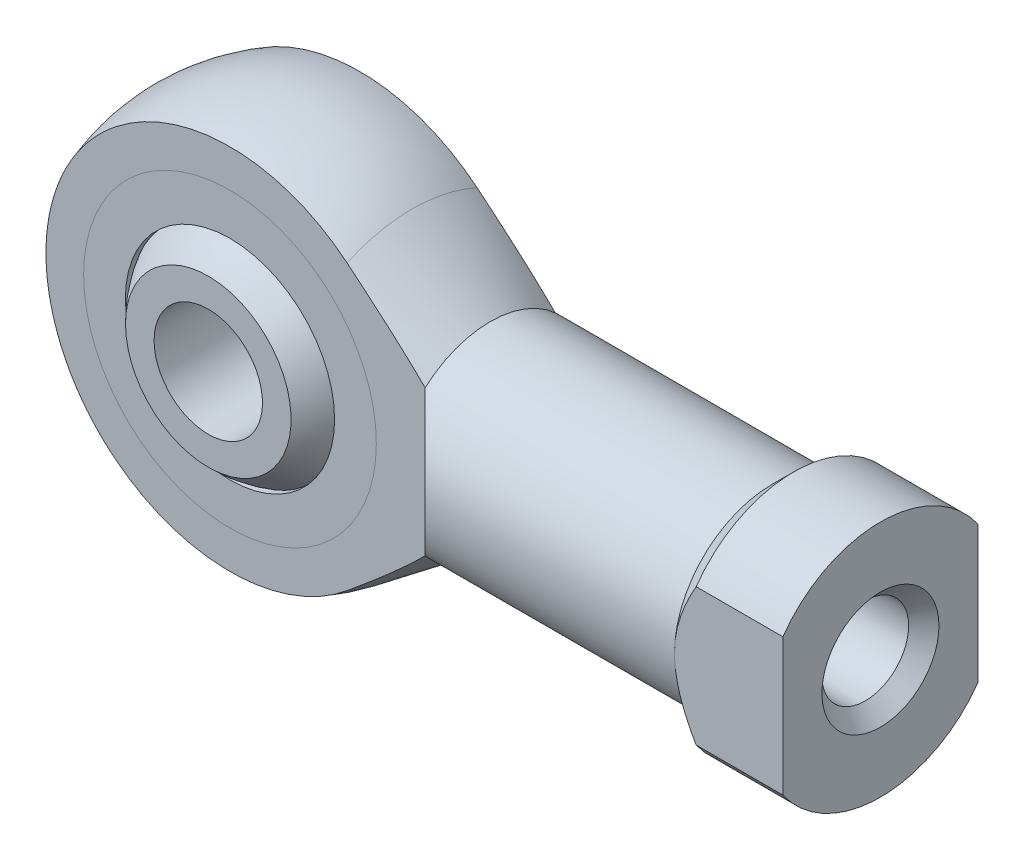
ISO-10303-21;
HEADER;
FILE_DESCRIPTION(('STEP AP214'),'2;1');
FILE_NAME('part.step','',(''),(''),'','','');
FILE_SCHEMA(('AUTOMOTIVE_DESIGN { 1 0 10303 214 1 1 1 1 }'));
ENDSEC;
DATA;
#1=APPLICATION_CONTEXT('core data for automotive mechanical design processes');
#2=APPLICATION_PROTOCOL_DEFINITION('international standard','automotive_design',2000,#1);
#3=PRODUCT_CONTEXT('',#1,'mechanical');
#4=PRODUCT('Part','Part','',(#3));
#5=PRODUCT_RELATED_PRODUCT_CATEGORY('part','',(#4));
#6=PRODUCT_DEFINITION_FORMATION('','',#4);
#7=PRODUCT_DEFINITION_CONTEXT('part definition',#1,'design');
#8=PRODUCT_DEFINITION('design','',#6,#7);
#9=PRODUCT_DEFINITION_SHAPE('','',#8);
#10=(LENGTH_UNIT() NAMED_UNIT(*) SI_UNIT(.MILLI.,.METRE.));
#11=(NAMED_UNIT(*) PLANE_ANGLE_UNIT() SI_UNIT($,.RADIAN.));
#12=(NAMED_UNIT(*) SI_UNIT($,.STERADIAN.) SOLID_ANGLE_UNIT());
#13=UNCERTAINTY_MEASURE_WITH_UNIT(LENGTH_MEASURE(1.E-05),#10,'distance_accuracy_value','');
#14=(GEOMETRIC_REPRESENTATION_CONTEXT(3) GLOBAL_UNCERTAINTY_ASSIGNED_CONTEXT((#13)) GLOBAL_UNIT_ASSIGNED_CONTEXT((#10,
#11,#12)) REPRESENTATION_CONTEXT('',''));
#15=CARTESIAN_POINT('',(0.,0.,0.));
#16=DIRECTION('',(0.,0.,1.));
#17=DIRECTION('',(1.,0.,0.));
#18=AXIS2_PLACEMENT_3D('',#15,#16,#17);
#19=CARTESIAN_POINT('',(0.,0.,0.));
#20=DIRECTION('',(0.,1.,0.));
#21=DIRECTION('',(1.,0.,0.));
#22=AXIS2_PLACEMENT_3D('',#19,#20,#21);
#23=SPHERICAL_SURFACE('',#22,5.53);
#24=CARTESIAN_POINT('',(0.,0.,0.));
#25=DIRECTION('',(0.,0.,-1.));
#26=DIRECTION('',(-1.,0.,0.));
#27=AXIS2_PLACEMENT_3D('',#24,#25,#26);
#28=SPHERICAL_SURFACE('',#27,5.53);
#29=CARTESIAN_POINT('',(0.,0.,4.));
#30=DIRECTION('',(0.,0.,-1.));
#31=DIRECTION('',(-1.,0.,0.));
#32=AXIS2_PLACEMENT_3D('',#29,#30,#31);
#33=CIRCLE('',#32,3.81849446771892);
#34=CARTESIAN_POINT('',(-3.81849446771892,0.,4.));
#35=VERTEX_POINT('',#34);
#36=EDGE_CURVE('P0_E26',#35,#35,#33,.F.);
#37=ORIENTED_EDGE('',*,*,#36,.F.);
#38=EDGE_LOOP('',(#37));
#39=FACE_BOUND('',#38,.T.);
#40=CARTESIAN_POINT('',(0.,0.,-4.));
#41=DIRECTION('',(0.,0.,1.));
#42=DIRECTION('',(1.,0.,0.));
#43=AXIS2_PLACEMENT_3D('',#40,#41,#42);
#44=CIRCLE('',#43,3.81849446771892);
#45=CARTESIAN_POINT('',(3.81849446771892,0.,-4.));
#46=VERTEX_POINT('',#45);
#47=EDGE_CURVE('P0_E10',#46,#46,#44,.F.);
#48=ORIENTED_EDGE('',*,*,#47,.F.);
#49=EDGE_LOOP('',(#48));
#50=FACE_BOUND('',#49,.T.);
#51=ADVANCED_FACE('P0_F14',(#39,#50),#28,.T.);
#52=CARTESIAN_POINT('',(0.,0.,-5.53));
#53=DIRECTION('',(0.,0.,1.));
#54=DIRECTION('',(1.,0.,0.));
#55=AXIS2_PLACEMENT_3D('',#52,#53,#54);
#56=CYLINDRICAL_SURFACE('',#55,2.5);
#57=CARTESIAN_POINT('',(0.,0.,4.));
#58=DIRECTION('',(0.,0.,-1.));
#59=DIRECTION('',(-1.,0.,0.));
#60=AXIS2_PLACEMENT_3D('',#57,#58,#59);
#61=CIRCLE('',#60,2.5);
#62=CARTESIAN_POINT('',(-2.5,0.,4.));
#63=VERTEX_POINT('',#62);
#64=EDGE_CURVE('P0_E17',#63,#63,#61,.F.);
#65=ORIENTED_EDGE('',*,*,#64,.T.);
#66=EDGE_LOOP('',(#65));
#67=FACE_BOUND('',#66,.T.);
#68=CARTESIAN_POINT('',(0.,0.,-4.));
#69=DIRECTION('',(0.,0.,1.));
#70=DIRECTION('',(1.,0.,0.));
#71=AXIS2_PLACEMENT_3D('',#68,#69,#70);
#72=CIRCLE('',#71,2.5);
#73=CARTESIAN_POINT('',(2.5,0.,-4.));
#74=VERTEX_POINT('',#73);
#75=EDGE_CURVE('P0_E21',#74,#74,#72,.F.);
#76=ORIENTED_EDGE('',*,*,#75,.T.);
#77=EDGE_LOOP('',(#76));
#78=FACE_BOUND('',#77,.T.);
#79=ADVANCED_FACE('P0_F34',(#67,#78),#56,.F.);
#80=CARTESIAN_POINT('',(-5.53,-5.53,-4.));
#81=DIRECTION('',(0.,0.,1.));
#82=DIRECTION('',(1.,0.,0.));
#83=AXIS2_PLACEMENT_3D('',#80,#81,#82);
#84=PLANE('',#83);
#85=ORIENTED_EDGE('',*,*,#47,.T.);
#86=EDGE_LOOP('',(#85));
#87=FACE_BOUND('',#86,.T.);
#88=ORIENTED_EDGE('',*,*,#75,.F.);
#89=EDGE_LOOP('',(#88));
#90=FACE_BOUND('',#89,.T.);
#91=ADVANCED_FACE('P0_F39',(#87,#90),#84,.F.);
#92=CARTESIAN_POINT('',(-5.53,-5.53,4.));
#93=DIRECTION('',(0.,0.,-1.));
#94=DIRECTION('',(-1.,0.,0.));
#95=AXIS2_PLACEMENT_3D('',#92,#93,#94);
#96=PLANE('',#95);
#97=ORIENTED_EDGE('',*,*,#36,.T.);
#98=EDGE_LOOP('',(#97));
#99=FACE_BOUND('',#98,.T.);
#100=ORIENTED_EDGE('',*,*,#64,.F.);
#101=EDGE_LOOP('',(#100));
#102=FACE_BOUND('',#101,.T.);
#103=ADVANCED_FACE('P0_F37',(#99,#102),#96,.F.);
#104=CLOSED_SHELL('',(#51,#79,#91,#103));
#105=MANIFOLD_SOLID_BREP('P0_B1',#104);
#106=CARTESIAN_POINT('',(0.,0.,3.));
#107=DIRECTION('',(0.,0.,1.));
#108=DIRECTION('',(1.,0.,0.));
#109=AXIS2_PLACEMENT_3D('',#106,#107,#108);
#110=PLANE('',#109);
#111=CARTESIAN_POINT('',(0.,0.,3.));
#112=DIRECTION('',(0.,0.,1.));
#113=DIRECTION('',(1.,0.,0.));
#114=AXIS2_PLACEMENT_3D('',#111,#112,#113);
#115=CIRCLE('',#114,6.75);
#116=CARTESIAN_POINT('',(6.75,0.,3.));
#117=VERTEX_POINT('',#116);
#118=EDGE_CURVE('P1_E10',#117,#117,#115,.T.);
#119=ORIENTED_EDGE('',*,*,#118,.T.);
#120=EDGE_LOOP('',(#119));
#121=FACE_BOUND('',#120,.T.);
#122=CARTESIAN_POINT('',(0.,0.,3.));
#123=DIRECTION('',(0.,0.,1.));
#124=DIRECTION('',(1.,0.,0.));
#125=AXIS2_PLACEMENT_3D('',#122,#123,#124);
#126=CIRCLE('',#125,4.825);
#127=CARTESIAN_POINT('',(4.825,0.,3.));
#128=VERTEX_POINT('',#127);
#129=EDGE_CURVE('P1_E25',#128,#128,#126,.T.);
#130=ORIENTED_EDGE('',*,*,#129,.F.);
#131=EDGE_LOOP('',(#130));
#132=FACE_BOUND('',#131,.T.);
#133=ADVANCED_FACE('P1_F14',(#121,#132),#110,.T.);
#134=CARTESIAN_POINT('',(0.,0.,2.7));
#135=DIRECTION('',(0.,0.,1.));
#136=DIRECTION('',(1.,0.,0.));
#137=AXIS2_PLACEMENT_3D('',#134,#135,#136);
#138=PLANE('',#137);
#139=CARTESIAN_POINT('',(0.,0.,2.7));
#140=DIRECTION('',(0.,0.,1.));
#141=DIRECTION('',(1.,0.,0.));
#142=AXIS2_PLACEMENT_3D('',#139,#140,#141);
#143=CIRCLE('',#142,6.75);
#144=CARTESIAN_POINT('',(6.75,0.,2.7));
#145=VERTEX_POINT('',#144);
#146=EDGE_CURVE('P1_E18',#145,#145,#143,.T.);
#147=ORIENTED_EDGE('',*,*,#146,.F.);
#148=EDGE_LOOP('',(#147));
#149=FACE_BOUND('',#148,.T.);
#150=CARTESIAN_POINT('',(0.,0.,2.7));
#151=DIRECTION('',(0.,0.,1.));
#152=DIRECTION('',(1.,0.,0.));
#153=AXIS2_PLACEMENT_3D('',#150,#151,#152);
#154=CIRCLE('',#153,4.825);
#155=CARTESIAN_POINT('',(4.825,0.,2.7));
#156=VERTEX_POINT('',#155);
#157=EDGE_CURVE('P1_E27',#156,#156,#154,.T.);
#158=ORIENTED_EDGE('',*,*,#157,.T.);
#159=EDGE_LOOP('',(#158));
#160=FACE_BOUND('',#159,.T.);
#161=ADVANCED_FACE('P1_F37',(#149,#160),#138,.F.);
#162=CARTESIAN_POINT('',(0.,0.,3.));
#163=DIRECTION('',(0.,0.,-1.));
#164=DIRECTION('',(-1.,0.,0.));
#165=AXIS2_PLACEMENT_3D('',#162,#163,#164);
#166=CYLINDRICAL_SURFACE('',#165,6.75);
#167=ORIENTED_EDGE('',*,*,#118,.F.);
#168=EDGE_LOOP('',(#167));
#169=FACE_BOUND('',#168,.T.);
#170=ORIENTED_EDGE('',*,*,#146,.T.);
#171=EDGE_LOOP('',(#170));
#172=FACE_BOUND('',#171,.T.);
#173=ADVANCED_FACE('P1_F16',(#169,#172),#166,.T.);
#174=CARTESIAN_POINT('',(0.,0.,3.));
#175=DIRECTION('',(0.,0.,-1.));
#176=DIRECTION('',(-1.,0.,0.));
#177=AXIS2_PLACEMENT_3D('',#174,#175,#176);
#178=CYLINDRICAL_SURFACE('',#177,4.825);
#179=ORIENTED_EDGE('',*,*,#129,.T.);
#180=EDGE_LOOP('',(#179));
#181=FACE_BOUND('',#180,.T.);
#182=ORIENTED_EDGE('',*,*,#157,.F.);
#183=EDGE_LOOP('',(#182));
#184=FACE_BOUND('',#183,.T.);
#185=ADVANCED_FACE('P1_F33',(#181,#184),#178,.F.);
#186=CLOSED_SHELL('',(#133,#161,#173,#185));
#187=MANIFOLD_SOLID_BREP('P1_B1',#186);
#188=CARTESIAN_POINT('',(0.,0.,-2.7));
#189=DIRECTION('',(0.,0.,1.));
#190=DIRECTION('',(1.,0.,0.));
#191=AXIS2_PLACEMENT_3D('',#188,#189,#190);
#192=PLANE('',#191);
#193=CARTESIAN_POINT('',(0.,0.,-2.7));
#194=DIRECTION('',(0.,0.,1.));
#195=DIRECTION('',(1.,0.,0.));
#196=AXIS2_PLACEMENT_3D('',#193,#194,#195);
#197=CIRCLE('',#196,6.75);
#198=CARTESIAN_POINT('',(6.75,0.,-2.7));
#199=VERTEX_POINT('',#198);
#200=EDGE_CURVE('P2_E10',#199,#199,#197,.T.);
#201=ORIENTED_EDGE('',*,*,#200,.T.);
#202=EDGE_LOOP('',(#201));
#203=FACE_BOUND('',#202,.T.);
#204=CARTESIAN_POINT('',(0.,0.,-2.7));
#205=DIRECTION('',(0.,0.,1.));
#206=DIRECTION('',(1.,0.,0.));
#207=AXIS2_PLACEMENT_3D('',#204,#205,#206);
#208=CIRCLE('',#207,4.825);
#209=CARTESIAN_POINT('',(4.825,0.,-2.7));
#210=VERTEX_POINT('',#209);
#211=EDGE_CURVE('P2_E25',#210,#210,#208,.T.);
#212=ORIENTED_EDGE('',*,*,#211,.F.);
#213=EDGE_LOOP('',(#212));
#214=FACE_BOUND('',#213,.T.);
#215=ADVANCED_FACE('P2_F14',(#203,#214),#192,.T.);
#216=CARTESIAN_POINT('',(0.,0.,-3.));
#217=DIRECTION('',(0.,0.,1.));
#218=DIRECTION('',(1.,0.,0.));
#219=AXIS2_PLACEMENT_3D('',#216,#217,#218);
#220=PLANE('',#219);
#221=CARTESIAN_POINT('',(0.,0.,-3.));
#222=DIRECTION('',(0.,0.,1.));
#223=DIRECTION('',(1.,0.,0.));
#224=AXIS2_PLACEMENT_3D('',#221,#222,#223);
#225=CIRCLE('',#224,6.75);
#226=CARTESIAN_POINT('',(6.75,0.,-3.));
#227=VERTEX_POINT('',#226);
#228=EDGE_CURVE('P2_E18',#227,#227,#225,.T.);
#229=ORIENTED_EDGE('',*,*,#228,.F.);
#230=EDGE_LOOP('',(#229));
#231=FACE_BOUND('',#230,.T.);
#232=CARTESIAN_POINT('',(0.,0.,-3.));
#233=DIRECTION('',(0.,0.,1.));
#234=DIRECTION('',(1.,0.,0.));
#235=AXIS2_PLACEMENT_3D('',#232,#233,#234);
#236=CIRCLE('',#235,4.825);
#237=CARTESIAN_POINT('',(4.825,0.,-3.));
#238=VERTEX_POINT('',#237);
#239=EDGE_CURVE('P2_E27',#238,#238,#236,.T.);
#240=ORIENTED_EDGE('',*,*,#239,.T.);
#241=EDGE_LOOP('',(#240));
#242=FACE_BOUND('',#241,.T.);
#243=ADVANCED_FACE('P2_F37',(#231,#242),#220,.F.);
#244=CARTESIAN_POINT('',(0.,0.,-2.7));
#245=DIRECTION('',(0.,0.,-1.));
#246=DIRECTION('',(-1.,0.,0.));
#247=AXIS2_PLACEMENT_3D('',#244,#245,#246);
#248=CYLINDRICAL_SURFACE('',#247,6.75);
#249=ORIENTED_EDGE('',*,*,#200,.F.);
#250=EDGE_LOOP('',(#249));
#251=FACE_BOUND('',#250,.T.);
#252=ORIENTED_EDGE('',*,*,#228,.T.);
#253=EDGE_LOOP('',(#252));
#254=FACE_BOUND('',#253,.T.);
#255=ADVANCED_FACE('P2_F16',(#251,#254),#248,.T.);
#256=CARTESIAN_POINT('',(0.,0.,-2.7));
#257=DIRECTION('',(0.,0.,-1.));
#258=DIRECTION('',(-1.,0.,0.));
#259=AXIS2_PLACEMENT_3D('',#256,#257,#258);
#260=CYLINDRICAL_SURFACE('',#259,4.825);
#261=ORIENTED_EDGE('',*,*,#211,.T.);
#262=EDGE_LOOP('',(#261));
#263=FACE_BOUND('',#262,.T.);
#264=ORIENTED_EDGE('',*,*,#239,.F.);
#265=EDGE_LOOP('',(#264));
#266=FACE_BOUND('',#265,.T.);
#267=ADVANCED_FACE('P2_F33',(#263,#266),#260,.F.);
#268=CLOSED_SHELL('',(#215,#243,#255,#267));
#269=MANIFOLD_SOLID_BREP('P2_B1',#268);
#270=CARTESIAN_POINT('',(0.,0.,0.));
#271=DIRECTION('',(0.,1.,0.));
#272=DIRECTION('',(1.,0.,0.));
#273=AXIS2_PLACEMENT_3D('',#270,#271,#272);
#274=SPHERICAL_SURFACE('',#273,5.53);
#275=CARTESIAN_POINT('',(0.,0.,0.));
#276=DIRECTION('',(0.,0.,1.));
#277=DIRECTION('',(1.,0.,0.));
#278=AXIS2_PLACEMENT_3D('',#275,#276,#277);
#279=SPHERICAL_SURFACE('',#278,5.53);
#280=CARTESIAN_POINT('',(0.,0.,2.7));
#281=DIRECTION('',(0.,0.,1.));
#282=DIRECTION('',(1.,0.,0.));
#283=AXIS2_PLACEMENT_3D('',#280,#281,#282);
#284=CIRCLE('',#283,4.82606464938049);
#285=CARTESIAN_POINT('',(4.82606464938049,0.,2.7));
#286=VERTEX_POINT('',#285);
#287=EDGE_CURVE('P3_E73',#286,#286,#284,.F.);
#288=ORIENTED_EDGE('',*,*,#287,.F.);
#289=EDGE_LOOP('',(#288));
#290=FACE_BOUND('',#289,.T.);
#291=CARTESIAN_POINT('',(0.,0.,-2.7));
#292=DIRECTION('',(0.,0.,-1.));
#293=DIRECTION('',(-1.,0.,0.));
#294=AXIS2_PLACEMENT_3D('',#291,#292,#293);
#295=CIRCLE('',#294,4.82606464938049);
#296=CARTESIAN_POINT('',(-4.82606464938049,0.,-2.7));
#297=VERTEX_POINT('',#296);
#298=EDGE_CURVE('P3_E20',#297,#297,#295,.F.);
#299=ORIENTED_EDGE('',*,*,#298,.F.);
#300=EDGE_LOOP('',(#299));
#301=FACE_BOUND('',#300,.T.);
#302=ADVANCED_FACE('P3_F16',(#290,#301),#279,.F.);
#303=CARTESIAN_POINT('',(-9.,-9.,-3.));
#304=DIRECTION('',(0.,0.,1.));
#305=DIRECTION('',(1.,0.,0.));
#306=AXIS2_PLACEMENT_3D('',#303,#304,#305);
#307=PLANE('',#306);
#308=CARTESIAN_POINT('',(0.,0.,-3.));
#309=DIRECTION('',(0.,0.,1.));
#310=DIRECTION('',(1.,0.,0.));
#311=AXIS2_PLACEMENT_3D('',#308,#309,#310);
#312=CIRCLE('',#311,8.48528137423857);
#313=CARTESIAN_POINT('',(5.4,6.54522726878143,-3.));
#314=VERTEX_POINT('',#313);
#315=CARTESIAN_POINT('',(5.4,-6.54522726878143,-3.));
#316=VERTEX_POINT('',#315);
#317=EDGE_CURVE('P3_E11',#314,#316,#312,.T.);
#318=ORIENTED_EDGE('',*,*,#317,.F.);
#319=CARTESIAN_POINT('',(-14.2271365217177,-21.7140933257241,-2.99999999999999));
#320=CARTESIAN_POINT('',(-13.2892236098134,-21.003931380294,-2.99999999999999));
#321=CARTESIAN_POINT('',(-12.3515831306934,-20.2934084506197,-2.99999999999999));
#322=CARTESIAN_POINT('',(-10.4771127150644,-18.8711801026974,-3.));
#323=CARTESIAN_POINT('',(-9.54028282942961,-18.1594746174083,-3.));
#324=CARTESIAN_POINT('',(-7.6661158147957,-16.7332150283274,-3.));
#325=CARTESIAN_POINT('',(-6.72878083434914,-16.0186581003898,-3.));
#326=CARTESIAN_POINT('',(-4.85591491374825,-14.5872872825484,-3.));
#327=CARTESIAN_POINT('',(-3.92038387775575,-13.870473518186,-3.));
#328=CARTESIAN_POINT('',(-2.54758468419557,-12.8144159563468,-3.));
#329=CARTESIAN_POINT('',(-2.10923729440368,-12.4765753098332,-3.));
#330=CARTESIAN_POINT('',(-1.23332717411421,-11.7998786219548,-3.));
#331=CARTESIAN_POINT('',(-0.7957644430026,-11.4610225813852,-3.));
#332=CARTESIAN_POINT('',(0.0784201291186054,-10.7819498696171,-3.));
#333=CARTESIAN_POINT('',(0.515041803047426,-10.4417329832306,-3.));
#334=CARTESIAN_POINT('',(1.38693518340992,-9.75958206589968,-3.));
#335=CARTESIAN_POINT('',(1.82220690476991,-9.41764805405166,-3.));
#336=CARTESIAN_POINT('',(2.69048820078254,-8.73177410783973,-3.));
#337=CARTESIAN_POINT('',(3.12349954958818,-8.38783642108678,-3.));
#338=CARTESIAN_POINT('',(3.98693879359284,-7.69668310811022,-3.));
#339=CARTESIAN_POINT('',(4.4173665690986,-7.34946733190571,-3.));
#340=CARTESIAN_POINT('',(5.06000268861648,-6.82507687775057,-3.));
#341=CARTESIAN_POINT('',(5.27368525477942,-6.64970943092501,-3.));
#342=CARTESIAN_POINT('',(5.69980714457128,-6.29747154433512,-3.));
#343=CARTESIAN_POINT('',(5.91224647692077,-6.12060111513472,-3.));
#344=CARTESIAN_POINT('',(6.33552363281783,-5.76498625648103,-3.));
#345=CARTESIAN_POINT('',(6.54636158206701,-5.5862419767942,-3.));
#346=CARTESIAN_POINT('',(6.96596428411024,-5.22633919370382,-3.));
#347=CARTESIAN_POINT('',(7.17472909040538,-5.045180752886,-3.));
#348=CARTESIAN_POINT('',(7.46338063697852,-4.79079938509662,-3.));
#349=CARTESIAN_POINT('',(7.54445190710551,-4.71891986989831,-3.));
#350=CARTESIAN_POINT('',(7.70610379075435,-4.57460934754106,-3.));
#351=CARTESIAN_POINT('',(7.78668439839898,-4.50217833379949,-3.));
#352=CARTESIAN_POINT('',(8.02761622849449,-4.28393841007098,-3.));
#353=CARTESIAN_POINT('',(8.1871326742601,-4.13720438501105,-3.));
#354=CARTESIAN_POINT('',(8.50539873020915,-3.83853427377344,-3.));
#355=CARTESIAN_POINT('',(8.66410736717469,-3.68655434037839,-3.));
#356=CARTESIAN_POINT('',(8.97728354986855,-3.37839862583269,-3.));
#357=CARTESIAN_POINT('',(9.13175281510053,-3.2222245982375,-3.));
#358=CARTESIAN_POINT('',(9.43704622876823,-2.90176145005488,-3.));
#359=CARTESIAN_POINT('',(9.5877806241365,-2.73738560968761,-3.));
#360=CARTESIAN_POINT('',(9.80702886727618,-2.4845468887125,-3.));
#361=CARTESIAN_POINT('',(9.87904453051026,-2.39912443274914,-3.));
#362=CARTESIAN_POINT('',(10.020093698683,-2.22585311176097,-3.));
#363=CARTESIAN_POINT('',(10.0891275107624,-2.13800449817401,-3.));
#364=CARTESIAN_POINT('',(10.2224359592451,-1.96071664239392,-3.));
#365=CARTESIAN_POINT('',(10.2867646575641,-1.87131829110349,-3.));
#366=CARTESIAN_POINT('',(10.4106749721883,-1.68921770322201,-3.));
#367=CARTESIAN_POINT('',(10.4702550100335,-1.59651438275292,-3.));
#368=CARTESIAN_POINT('',(10.5829440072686,-1.40772462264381,-3.));
#369=CARTESIAN_POINT('',(10.6360780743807,-1.31165332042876,-3.));
#370=CARTESIAN_POINT('',(10.7341764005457,-1.11544076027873,-3.));
#371=CARTESIAN_POINT('',(10.7791472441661,-1.01530286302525,-3.));
#372=CARTESIAN_POINT('',(10.8471079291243,-0.840247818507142,-3.));
#373=CARTESIAN_POINT('',(10.8727015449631,-0.766345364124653,-3.));
#374=CARTESIAN_POINT('',(10.917542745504,-0.616604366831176,-3.));
#375=CARTESIAN_POINT('',(10.9367897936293,-0.540765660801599,-3.));
#376=CARTESIAN_POINT('',(10.9679640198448,-0.387845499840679,-3.));
#377=CARTESIAN_POINT('',(10.979915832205,-0.310769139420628,-3.));
#378=CARTESIAN_POINT('',(10.9959336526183,-0.155795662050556,-3.));
#379=CARTESIAN_POINT('',(11.0000004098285,-0.0778986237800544,-3.));
#380=CARTESIAN_POINT('',(10.9999995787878,0.0800623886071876,-3.));
#381=CARTESIAN_POINT('',(10.9957029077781,0.160126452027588,-3.));
#382=CARTESIAN_POINT('',(10.978792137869,0.319363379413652,-3.));
#383=CARTESIAN_POINT('',(10.9661771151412,0.398536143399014,-3.));
#384=CARTESIAN_POINT('',(10.9333134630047,0.555543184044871,-3.));
#385=CARTESIAN_POINT('',(10.91303858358,0.633371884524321,-3.));
#386=CARTESIAN_POINT('',(10.865853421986,0.787005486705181,-3.));
#387=CARTESIAN_POINT('',(10.8389394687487,0.86280924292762,-3.));
#388=CARTESIAN_POINT('',(10.765436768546,1.0476373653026,-3.));
#389=CARTESIAN_POINT('',(10.7155724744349,1.15535464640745,-3.));
#390=CARTESIAN_POINT('',(10.6067368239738,1.36606414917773,-3.));
#391=CARTESIAN_POINT('',(10.5477592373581,1.46905307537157,-3.));
#392=CARTESIAN_POINT('',(10.4228166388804,1.67115493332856,-3.));
#393=CARTESIAN_POINT('',(10.3568281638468,1.77025322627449,-3.));
#394=CARTESIAN_POINT('',(10.2540256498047,1.91614177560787,-3.));
#395=CARTESIAN_POINT('',(10.219127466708,1.9643039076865,-3.));
#396=CARTESIAN_POINT('',(10.1482090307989,2.05979424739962,-3.));
#397=CARTESIAN_POINT('',(10.1121888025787,2.10712247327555,-3.));
#398=CARTESIAN_POINT('',(9.99545069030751,2.25724182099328,-3.));
#399=CARTESIAN_POINT('',(9.91286148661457,2.35857954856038,-3.));
#400=CARTESIAN_POINT('',(9.74411408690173,2.55824989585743,-3.));
#401=CARTESIAN_POINT('',(9.65795510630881,2.65658184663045,-3.));
#402=CARTESIAN_POINT('',(9.48282172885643,2.85082537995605,-3.));
#403=CARTESIAN_POINT('',(9.3938453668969,2.94673518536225,-3.));
#404=CARTESIAN_POINT('',(9.21371170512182,3.1364886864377,-3.));
#405=CARTESIAN_POINT('',(9.12255425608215,3.23033223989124,-3.));
#406=CARTESIAN_POINT('',(8.84599285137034,3.50978519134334,-3.));
#407=CARTESIAN_POINT('',(8.65797188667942,3.69280289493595,-3.));
#408=CARTESIAN_POINT('',(8.27737424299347,4.05383600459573,-3.));
#409=CARTESIAN_POINT('',(8.08479943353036,4.23185340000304,-3.));
#410=CARTESIAN_POINT('',(7.69482184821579,4.58564534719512,-3.));
#411=CARTESIAN_POINT('',(7.49739292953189,4.76139101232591,-3.));
#412=CARTESIAN_POINT('',(7.10007160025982,5.11010485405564,-3.));
#413=CARTESIAN_POINT('',(6.90017895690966,5.28307276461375,-3.));
#414=CARTESIAN_POINT('',(6.49890410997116,5.62653878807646,-3.));
#415=CARTESIAN_POINT('',(6.29752520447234,5.79704076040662,-3.));
#416=CARTESIAN_POINT('',(5.89334430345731,6.13633198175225,-3.));
#417=CARTESIAN_POINT('',(5.69054235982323,6.30512129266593,-3.));
#418=CARTESIAN_POINT('',(5.07628445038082,6.81290094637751,-3.));
#419=CARTESIAN_POINT('',(4.66310034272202,7.14979978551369,-3.));
#420=CARTESIAN_POINT('',(3.83374316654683,7.81990222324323,-3.));
#421=CARTESIAN_POINT('',(3.41757003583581,8.15310574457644,-3.));
#422=CARTESIAN_POINT('',(2.58311203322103,8.81691442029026,-3.));
#423=CARTESIAN_POINT('',(2.16482701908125,9.14751939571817,-3.));
#424=CARTESIAN_POINT('',(1.32675019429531,9.80681438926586,-3.));
#425=CARTESIAN_POINT('',(0.906958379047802,10.1355044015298,-3.));
#426=CARTESIAN_POINT('',(0.0658270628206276,10.7917694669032,-3.));
#427=CARTESIAN_POINT('',(-0.355513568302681,11.1193430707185,-3.));
#428=CARTESIAN_POINT('',(-1.19906331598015,11.7733712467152,-3.));
#429=CARTESIAN_POINT('',(-1.62127243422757,12.0998258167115,-3.));
#430=CARTESIAN_POINT('',(-2.88887532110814,13.0778542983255,-3.));
#431=CARTESIAN_POINT('',(-3.73527867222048,13.7281194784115,-3.));
#432=CARTESIAN_POINT('',(-5.384650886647,14.9917790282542,-3.));
#433=CARTESIAN_POINT('',(-6.18752979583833,15.6052909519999,-3.));
#434=CARTESIAN_POINT('',(-7.79439465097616,16.8308839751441,-3.));
#435=CARTESIAN_POINT('',(-8.59838061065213,17.4429650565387,-3.));
#436=CARTESIAN_POINT('',(-10.206163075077,18.6653367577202,-3.));
#437=CARTESIAN_POINT('',(-11.0099586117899,19.2756286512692,-3.));
#438=CARTESIAN_POINT('',(-12.6181446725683,20.4954044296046,-2.99999999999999));
#439=CARTESIAN_POINT('',(-13.4225351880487,21.1048883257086,-2.99999999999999));
#440=CARTESIAN_POINT('',(-14.2271365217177,21.7140933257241,-2.99999999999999));
#441=B_SPLINE_CURVE_WITH_KNOTS('',3,(#319,#320,#321,#322,#323,#324,#325,#326,#327,#328,#329,
#330,#331,#332,#333,#334,#335,#336,#337,#338,#339,#340,#341,#342,#343,#344,#345,#346,#347,#348,
#349,#350,#351,#352,#353,#354,#355,#356,#357,#358,#359,#360,#361,#362,#363,#364,#365,#366,#367,
#368,#369,#370,#371,#372,#373,#374,#375,#376,#377,#378,#379,#380,#381,#382,#383,#384,#385,#386,
#387,#388,#389,#390,#391,#392,#393,#394,#395,#396,#397,#398,#399,#400,#401,#402,#403,#404,#405,
#406,#407,#408,#409,#410,#411,#412,#413,#414,#415,#416,#417,#418,#419,#420,#421,#422,#423,#424,
#425,#426,#427,#428,#429,#430,#431,#432,#433,#434,#435,#436,#437,#438,#439,#440),.UNSPECIFIED.,
.F.,.F.,(4,2,2,2,2,2,2,2,2,2,2,2,2,2,2,2,2,2,2,2,2,2,2,2,2,2,2,2,2,2,2,2,2,2,2,2,2,2,2,2,2,2,2,
2,2,2,2,2,2,2,2,2,2,2,2,2,2,2,2,2,4),(0.,3.52932045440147,7.05884832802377,10.5947616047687,
14.1304815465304,15.7907703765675,17.4510579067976,19.1116192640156,20.7721621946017,
22.4311067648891,24.0901276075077,24.919414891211,25.7486963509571,26.5779120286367,
27.4071062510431,27.7321470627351,28.057191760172,28.7073801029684,29.3665426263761,
30.025433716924,30.6942336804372,31.0293689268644,31.3644695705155,31.6947635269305,
32.0251668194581,32.3542387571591,32.6830440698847,32.9174334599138,33.1518426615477,
33.3854558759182,33.6190468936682,33.8591262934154,34.0992323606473,34.3401688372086,
34.5812388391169,34.9367154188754,35.2924361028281,35.6493871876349,35.8278050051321,
36.0062189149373,36.398287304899,36.7904423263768,37.1828771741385,37.5753389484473,
38.3623545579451,39.1490524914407,39.9419743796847,40.7349717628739,41.5265528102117,
42.3181051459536,43.9174414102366,45.5168110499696,47.1162898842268,48.7157736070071,
50.3168619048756,51.9179533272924,55.1200067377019,58.1513583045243,61.18274781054,
64.2104347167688,67.2380787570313),.UNSPECIFIED.);
#442=CARTESIAN_POINT('',(9.,3.35410196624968,-3.));
#443=VERTEX_POINT('',#442);
#444=EDGE_CURVE('P3_E102',#443,#314,#441,.T.);
#445=ORIENTED_EDGE('',*,*,#444,.F.);
#446=DIRECTION('',(0.,1.,0.));
#447=VECTOR('',#446,1.);
#448=CARTESIAN_POINT('',(9.,-9.,-3.));
#449=LINE('',#448,#447);
#450=CARTESIAN_POINT('',(9.,-3.35410196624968,-3.));
#451=VERTEX_POINT('',#450);
#452=EDGE_CURVE('P3_E64',#451,#443,#449,.T.);
#453=ORIENTED_EDGE('',*,*,#452,.F.);
#454=EDGE_CURVE('P3_E33',#316,#451,#441,.T.);
#455=ORIENTED_EDGE('',*,*,#454,.F.);
#456=EDGE_LOOP('',(#318,#445,#453,#455));
#457=FACE_BOUND('',#456,.T.);
#458=CARTESIAN_POINT('',(0.,0.,-3.));
#459=DIRECTION('',(0.,0.,1.));
#460=DIRECTION('',(1.,0.,0.));
#461=AXIS2_PLACEMENT_3D('',#458,#459,#460);
#462=CIRCLE('',#461,6.75);
#463=CARTESIAN_POINT('',(6.75,0.,-3.));
#464=VERTEX_POINT('',#463);
#465=EDGE_CURVE('P3_E95',#464,#464,#462,.T.);
#466=ORIENTED_EDGE('',*,*,#465,.T.);
#467=EDGE_LOOP('',(#466));
#468=FACE_BOUND('',#467,.T.);
#469=ADVANCED_FACE('P3_F115',(#457,#468),#307,.F.);
#470=CARTESIAN_POINT('',(9.,0.,0.));
#471=DIRECTION('',(-1.,0.,0.));
#472=DIRECTION('',(0.,0.,1.));
#473=AXIS2_PLACEMENT_3D('',#470,#471,#472);
#474=CONICAL_SURFACE('',#473,4.5,0.643501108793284);
#475=CARTESIAN_POINT('',(5.4,0.,0.));
#476=DIRECTION('',(-1.,0.,0.));
#477=DIRECTION('',(0.,0.,1.));
#478=AXIS2_PLACEMENT_3D('',#475,#476,#477);
#479=CIRCLE('',#478,7.2);
#480=CARTESIAN_POINT('',(5.4,-6.54522726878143,3.));
#481=VERTEX_POINT('',#480);
#482=EDGE_CURVE('P3_E79',#316,#481,#479,.T.);
#483=ORIENTED_EDGE('',*,*,#482,.F.);
#484=ORIENTED_EDGE('',*,*,#454,.T.);
#485=CARTESIAN_POINT('',(9.,0.,0.));
#486=DIRECTION('',(-1.,0.,0.));
#487=DIRECTION('',(0.,0.,1.));
#488=AXIS2_PLACEMENT_3D('',#485,#486,#487);
#489=CIRCLE('',#488,4.5);
#490=CARTESIAN_POINT('',(9.,-3.35410196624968,3.));
#491=VERTEX_POINT('',#490);
#492=EDGE_CURVE('P3_E70',#451,#491,#489,.T.);
#493=ORIENTED_EDGE('',*,*,#492,.T.);
#494=CARTESIAN_POINT('',(-14.2271365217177,21.7140933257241,2.99999999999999));
#495=CARTESIAN_POINT('',(-13.2892236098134,21.003931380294,2.99999999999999));
#496=CARTESIAN_POINT('',(-12.3515831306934,20.2934084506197,2.99999999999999));
#497=CARTESIAN_POINT('',(-10.4771127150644,18.8711801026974,3.));
#498=CARTESIAN_POINT('',(-9.54028282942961,18.1594746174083,3.));
#499=CARTESIAN_POINT('',(-7.6661158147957,16.7332150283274,3.));
#500=CARTESIAN_POINT('',(-6.72878083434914,16.0186581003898,3.));
#501=CARTESIAN_POINT('',(-4.85591491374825,14.5872872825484,3.));
#502=CARTESIAN_POINT('',(-3.92038387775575,13.870473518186,3.));
#503=CARTESIAN_POINT('',(-2.54758468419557,12.8144159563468,3.));
#504=CARTESIAN_POINT('',(-2.10923729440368,12.4765753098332,3.));
#505=CARTESIAN_POINT('',(-1.23332717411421,11.7998786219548,3.));
#506=CARTESIAN_POINT('',(-0.7957644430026,11.4610225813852,3.));
#507=CARTESIAN_POINT('',(0.0784201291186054,10.7819498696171,3.));
#508=CARTESIAN_POINT('',(0.515041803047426,10.4417329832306,3.));
#509=CARTESIAN_POINT('',(1.38693518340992,9.75958206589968,3.));
#510=CARTESIAN_POINT('',(1.82220690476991,9.41764805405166,3.));
#511=CARTESIAN_POINT('',(2.69048820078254,8.73177410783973,3.));
#512=CARTESIAN_POINT('',(3.12349954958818,8.38783642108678,3.));
#513=CARTESIAN_POINT('',(3.98693879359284,7.69668310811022,3.));
#514=CARTESIAN_POINT('',(4.4173665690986,7.34946733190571,3.));
#515=CARTESIAN_POINT('',(5.06000268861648,6.82507687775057,3.));
#516=CARTESIAN_POINT('',(5.27368525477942,6.64970943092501,3.));
#517=CARTESIAN_POINT('',(5.69980714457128,6.29747154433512,3.));
#518=CARTESIAN_POINT('',(5.91224647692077,6.12060111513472,3.));
#519=CARTESIAN_POINT('',(6.33552363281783,5.76498625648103,3.));
#520=CARTESIAN_POINT('',(6.54636158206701,5.5862419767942,3.));
#521=CARTESIAN_POINT('',(6.96596428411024,5.22633919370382,3.));
#522=CARTESIAN_POINT('',(7.17472909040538,5.045180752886,3.));
#523=CARTESIAN_POINT('',(7.46338063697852,4.79079938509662,3.));
#524=CARTESIAN_POINT('',(7.54445190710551,4.71891986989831,3.));
#525=CARTESIAN_POINT('',(7.70610379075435,4.57460934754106,3.));
#526=CARTESIAN_POINT('',(7.78668439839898,4.50217833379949,3.));
#527=CARTESIAN_POINT('',(8.02761622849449,4.28393841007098,3.));
#528=CARTESIAN_POINT('',(8.1871326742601,4.13720438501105,3.));
#529=CARTESIAN_POINT('',(8.50539873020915,3.83853427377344,3.));
#530=CARTESIAN_POINT('',(8.66410736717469,3.68655434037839,3.));
#531=CARTESIAN_POINT('',(8.97728354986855,3.37839862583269,3.));
#532=CARTESIAN_POINT('',(9.13175281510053,3.2222245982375,3.));
#533=CARTESIAN_POINT('',(9.43704622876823,2.90176145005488,3.));
#534=CARTESIAN_POINT('',(9.5877806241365,2.73738560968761,3.));
#535=CARTESIAN_POINT('',(9.80702886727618,2.4845468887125,3.));
#536=CARTESIAN_POINT('',(9.87904453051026,2.39912443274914,3.));
#537=CARTESIAN_POINT('',(10.020093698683,2.22585311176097,3.));
#538=CARTESIAN_POINT('',(10.0891275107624,2.13800449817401,3.));
#539=CARTESIAN_POINT('',(10.2224359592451,1.96071664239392,3.));
#540=CARTESIAN_POINT('',(10.2867646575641,1.87131829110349,3.));
#541=CARTESIAN_POINT('',(10.4106749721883,1.68921770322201,3.));
#542=CARTESIAN_POINT('',(10.4702550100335,1.59651438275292,3.));
#543=CARTESIAN_POINT('',(10.5829440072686,1.40772462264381,3.));
#544=CARTESIAN_POINT('',(10.6360780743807,1.31165332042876,3.));
#545=CARTESIAN_POINT('',(10.7341764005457,1.11544076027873,3.));
#546=CARTESIAN_POINT('',(10.7791472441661,1.01530286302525,3.));
#547=CARTESIAN_POINT('',(10.8471079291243,0.840247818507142,3.));
#548=CARTESIAN_POINT('',(10.8727015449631,0.766345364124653,3.));
#549=CARTESIAN_POINT('',(10.917542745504,0.616604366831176,3.));
#550=CARTESIAN_POINT('',(10.9367897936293,0.540765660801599,3.));
#551=CARTESIAN_POINT('',(10.9679640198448,0.387845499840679,3.));
#552=CARTESIAN_POINT('',(10.979915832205,0.310769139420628,3.));
#553=CARTESIAN_POINT('',(10.9959336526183,0.155795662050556,3.));
#554=CARTESIAN_POINT('',(11.0000004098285,0.0778986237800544,3.));
#555=CARTESIAN_POINT('',(10.9999995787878,-0.0800623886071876,3.));
#556=CARTESIAN_POINT('',(10.9957029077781,-0.160126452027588,3.));
#557=CARTESIAN_POINT('',(10.978792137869,-0.319363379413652,3.));
#558=CARTESIAN_POINT('',(10.9661771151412,-0.398536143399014,3.));
#559=CARTESIAN_POINT('',(10.9333134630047,-0.555543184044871,3.));
#560=CARTESIAN_POINT('',(10.91303858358,-0.633371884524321,3.));
#561=CARTESIAN_POINT('',(10.865853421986,-0.787005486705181,3.));
#562=CARTESIAN_POINT('',(10.8389394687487,-0.86280924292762,3.));
#563=CARTESIAN_POINT('',(10.765436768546,-1.0476373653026,3.));
#564=CARTESIAN_POINT('',(10.7155724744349,-1.15535464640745,3.));
#565=CARTESIAN_POINT('',(10.6067368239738,-1.36606414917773,3.));
#566=CARTESIAN_POINT('',(10.5477592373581,-1.46905307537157,3.));
#567=CARTESIAN_POINT('',(10.4228166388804,-1.67115493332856,3.));
#568=CARTESIAN_POINT('',(10.3568281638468,-1.77025322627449,3.));
#569=CARTESIAN_POINT('',(10.2540256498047,-1.91614177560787,3.));
#570=CARTESIAN_POINT('',(10.219127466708,-1.9643039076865,3.));
#571=CARTESIAN_POINT('',(10.1482090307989,-2.05979424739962,3.));
#572=CARTESIAN_POINT('',(10.1121888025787,-2.10712247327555,3.));
#573=CARTESIAN_POINT('',(9.99545069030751,-2.25724182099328,3.));
#574=CARTESIAN_POINT('',(9.91286148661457,-2.35857954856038,3.));
#575=CARTESIAN_POINT('',(9.74411408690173,-2.55824989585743,3.));
#576=CARTESIAN_POINT('',(9.65795510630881,-2.65658184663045,3.));
#577=CARTESIAN_POINT('',(9.48282172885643,-2.85082537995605,3.));
#578=CARTESIAN_POINT('',(9.3938453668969,-2.94673518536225,3.));
#579=CARTESIAN_POINT('',(9.21371170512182,-3.1364886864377,3.));
#580=CARTESIAN_POINT('',(9.12255425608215,-3.23033223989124,3.));
#581=CARTESIAN_POINT('',(8.84599285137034,-3.50978519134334,3.));
#582=CARTESIAN_POINT('',(8.65797188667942,-3.69280289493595,3.));
#583=CARTESIAN_POINT('',(8.27737424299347,-4.05383600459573,3.));
#584=CARTESIAN_POINT('',(8.08479943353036,-4.23185340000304,3.));
#585=CARTESIAN_POINT('',(7.69482184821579,-4.58564534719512,3.));
#586=CARTESIAN_POINT('',(7.49739292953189,-4.76139101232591,3.));
#587=CARTESIAN_POINT('',(7.10007160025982,-5.11010485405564,3.));
#588=CARTESIAN_POINT('',(6.90017895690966,-5.28307276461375,3.));
#589=CARTESIAN_POINT('',(6.49890410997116,-5.62653878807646,3.));
#590=CARTESIAN_POINT('',(6.29752520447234,-5.79704076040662,3.));
#591=CARTESIAN_POINT('',(5.89334430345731,-6.13633198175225,3.));
#592=CARTESIAN_POINT('',(5.69054235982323,-6.30512129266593,3.));
#593=CARTESIAN_POINT('',(5.07628445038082,-6.81290094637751,3.));
#594=CARTESIAN_POINT('',(4.66310034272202,-7.14979978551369,3.));
#595=CARTESIAN_POINT('',(3.83374316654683,-7.81990222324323,3.));
#596=CARTESIAN_POINT('',(3.41757003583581,-8.15310574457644,3.));
#597=CARTESIAN_POINT('',(2.58311203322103,-8.81691442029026,3.));
#598=CARTESIAN_POINT('',(2.16482701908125,-9.14751939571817,3.));
#599=CARTESIAN_POINT('',(1.32675019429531,-9.80681438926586,3.));
#600=CARTESIAN_POINT('',(0.906958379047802,-10.1355044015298,3.));
#601=CARTESIAN_POINT('',(0.0658270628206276,-10.7917694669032,3.));
#602=CARTESIAN_POINT('',(-0.355513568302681,-11.1193430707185,3.));
#603=CARTESIAN_POINT('',(-1.19906331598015,-11.7733712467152,3.));
#604=CARTESIAN_POINT('',(-1.62127243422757,-12.0998258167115,3.));
#605=CARTESIAN_POINT('',(-2.88887532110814,-13.0778542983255,3.));
#606=CARTESIAN_POINT('',(-3.73527867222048,-13.7281194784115,3.));
#607=CARTESIAN_POINT('',(-5.384650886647,-14.9917790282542,3.));
#608=CARTESIAN_POINT('',(-6.18752979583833,-15.6052909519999,3.));
#609=CARTESIAN_POINT('',(-7.79439465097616,-16.8308839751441,3.));
#610=CARTESIAN_POINT('',(-8.59838061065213,-17.4429650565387,3.));
#611=CARTESIAN_POINT('',(-10.206163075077,-18.6653367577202,3.));
#612=CARTESIAN_POINT('',(-11.0099586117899,-19.2756286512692,3.));
#613=CARTESIAN_POINT('',(-12.6181446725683,-20.4954044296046,2.99999999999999));
#614=CARTESIAN_POINT('',(-13.4225351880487,-21.1048883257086,2.99999999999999));
#615=CARTESIAN_POINT('',(-14.2271365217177,-21.7140933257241,2.99999999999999));
#616=B_SPLINE_CURVE_WITH_KNOTS('',3,(#494,#495,#496,#497,#498,#499,#500,#501,#502,#503,#504,
#505,#506,#507,#508,#509,#510,#511,#512,#513,#514,#515,#516,#517,#518,#519,#520,#521,#522,#523,
#524,#525,#526,#527,#528,#529,#530,#531,#532,#533,#534,#535,#536,#537,#538,#539,#540,#541,#542,
#543,#544,#545,#546,#547,#548,#549,#550,#551,#552,#553,#554,#555,#556,#557,#558,#559,#560,#561,
#562,#563,#564,#565,#566,#567,#568,#569,#570,#571,#572,#573,#574,#575,#576,#577,#578,#579,#580,
#581,#582,#583,#584,#585,#586,#587,#588,#589,#590,#591,#592,#593,#594,#595,#596,#597,#598,#599,
#600,#601,#602,#603,#604,#605,#606,#607,#608,#609,#610,#611,#612,#613,#614,#615),.UNSPECIFIED.,
.F.,.F.,(4,2,2,2,2,2,2,2,2,2,2,2,2,2,2,2,2,2,2,2,2,2,2,2,2,2,2,2,2,2,2,2,2,2,2,2,2,2,2,2,2,2,2,
2,2,2,2,2,2,2,2,2,2,2,2,2,2,2,2,2,4),(0.,3.52932045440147,7.05884832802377,10.5947616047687,
14.1304815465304,15.7907703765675,17.4510579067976,19.1116192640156,20.7721621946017,
22.4311067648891,24.0901276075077,24.919414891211,25.7486963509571,26.5779120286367,
27.4071062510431,27.7321470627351,28.057191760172,28.7073801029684,29.3665426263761,
30.025433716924,30.6942336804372,31.0293689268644,31.3644695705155,31.6947635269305,
32.0251668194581,32.3542387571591,32.6830440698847,32.9174334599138,33.1518426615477,
33.3854558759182,33.6190468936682,33.8591262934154,34.0992323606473,34.3401688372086,
34.5812388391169,34.9367154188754,35.2924361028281,35.6493871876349,35.8278050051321,
36.0062189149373,36.398287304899,36.7904423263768,37.1828771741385,37.5753389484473,
38.3623545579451,39.1490524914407,39.9419743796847,40.7349717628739,41.5265528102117,
42.3181051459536,43.9174414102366,45.5168110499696,47.1162898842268,48.7157736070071,
50.3168619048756,51.9179533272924,55.1200067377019,58.1513583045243,61.18274781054,
64.2104347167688,67.2380787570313),.UNSPECIFIED.);
#617=EDGE_CURVE('P3_E56',#491,#481,#616,.T.);
#618=ORIENTED_EDGE('',*,*,#617,.T.);
#619=EDGE_LOOP('',(#483,#484,#493,#618));
#620=FACE_BOUND('',#619,.T.);
#621=ADVANCED_FACE('P3_F75',(#620),#474,.T.);
#622=CARTESIAN_POINT('',(9.,0.,0.));
#623=DIRECTION('',(-1.,0.,0.));
#624=DIRECTION('',(0.,0.,1.));
#625=AXIS2_PLACEMENT_3D('',#622,#623,#624);
#626=PLANE('',#625);
#627=ORIENTED_EDGE('',*,*,#492,.F.);
#628=ORIENTED_EDGE('',*,*,#452,.T.);
#629=CARTESIAN_POINT('',(9.,3.35410196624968,3.));
#630=VERTEX_POINT('',#629);
#631=EDGE_CURVE('P3_E72',#630,#443,#489,.T.);
#632=ORIENTED_EDGE('',*,*,#631,.F.);
#633=DIRECTION('',(0.,1.,0.));
#634=VECTOR('',#633,1.);
#635=CARTESIAN_POINT('',(9.,-9.,3.));
#636=LINE('',#635,#634);
#637=EDGE_CURVE('P3_E59',#491,#630,#636,.T.);
#638=ORIENTED_EDGE('',*,*,#637,.F.);
#639=EDGE_LOOP('',(#627,#628,#632,#638));
#640=FACE_BOUND('',#639,.T.);
#641=ADVANCED_FACE('P3_F18',(#640),#626,.F.);
#642=ORIENTED_EDGE('',*,*,#631,.T.);
#643=ORIENTED_EDGE('',*,*,#444,.T.);
#644=CARTESIAN_POINT('',(5.4,6.54522726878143,3.));
#645=VERTEX_POINT('',#644);
#646=EDGE_CURVE('P3_E76',#645,#314,#479,.T.);
#647=ORIENTED_EDGE('',*,*,#646,.F.);
#648=EDGE_CURVE('P3_E40',#645,#630,#616,.T.);
#649=ORIENTED_EDGE('',*,*,#648,.T.);
#650=EDGE_LOOP('',(#642,#643,#647,#649));
#651=FACE_BOUND('',#650,.T.);
#652=ADVANCED_FACE('P3_F107',(#651),#474,.T.);
#653=CARTESIAN_POINT('',(0.,0.,0.));
#654=DIRECTION('',(-1.,0.,0.));
#655=DIRECTION('',(0.,1.,0.));
#656=AXIS2_PLACEMENT_3D('',#653,#654,#655);
#657=SPHERICAL_SURFACE('',#656,9.);
#658=ORIENTED_EDGE('',*,*,#646,.T.);
#659=ORIENTED_EDGE('',*,*,#317,.T.);
#660=ORIENTED_EDGE('',*,*,#482,.T.);
#661=CARTESIAN_POINT('',(0.,0.,3.));
#662=DIRECTION('',(0.,0.,-1.));
#663=DIRECTION('',(-1.,0.,0.));
#664=AXIS2_PLACEMENT_3D('',#661,#662,#663);
#665=CIRCLE('',#664,8.48528137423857);
#666=EDGE_CURVE('P3_E25',#481,#645,#665,.T.);
#667=ORIENTED_EDGE('',*,*,#666,.T.);
#668=EDGE_LOOP('',(#658,#659,#660,#667));
#669=FACE_BOUND('',#668,.T.);
#670=ADVANCED_FACE('P3_F113',(#669),#657,.T.);
#671=CARTESIAN_POINT('',(-9.,-9.,3.));
#672=DIRECTION('',(0.,0.,-1.));
#673=DIRECTION('',(-1.,0.,0.));
#674=AXIS2_PLACEMENT_3D('',#671,#672,#673);
#675=PLANE('',#674);
#676=CARTESIAN_POINT('',(0.,0.,3.));
#677=DIRECTION('',(0.,0.,1.));
#678=DIRECTION('',(1.,0.,0.));
#679=AXIS2_PLACEMENT_3D('',#676,#677,#678);
#680=CIRCLE('',#679,6.75);
#681=CARTESIAN_POINT('',(6.75,0.,3.));
#682=VERTEX_POINT('',#681);
#683=EDGE_CURVE('P3_E88',#682,#682,#680,.T.);
#684=ORIENTED_EDGE('',*,*,#683,.F.);
#685=EDGE_LOOP('',(#684));
#686=FACE_BOUND('',#685,.T.);
#687=ORIENTED_EDGE('',*,*,#666,.F.);
#688=ORIENTED_EDGE('',*,*,#617,.F.);
#689=ORIENTED_EDGE('',*,*,#637,.T.);
#690=ORIENTED_EDGE('',*,*,#648,.F.);
#691=EDGE_LOOP('',(#687,#688,#689,#690));
#692=FACE_BOUND('',#691,.T.);
#693=ADVANCED_FACE('P3_F58',(#686,#692),#675,.F.);
#694=CARTESIAN_POINT('',(0.,0.,2.7));
#695=DIRECTION('',(0.,0.,1.));
#696=DIRECTION('',(1.,0.,0.));
#697=AXIS2_PLACEMENT_3D('',#694,#695,#696);
#698=PLANE('',#697);
#699=CARTESIAN_POINT('',(0.,0.,2.7));
#700=DIRECTION('',(0.,0.,1.));
#701=DIRECTION('',(1.,0.,0.));
#702=AXIS2_PLACEMENT_3D('',#699,#700,#701);
#703=CIRCLE('',#702,6.75);
#704=CARTESIAN_POINT('',(6.75,0.,2.7));
#705=VERTEX_POINT('',#704);
#706=EDGE_CURVE('P3_E84',#705,#705,#703,.T.);
#707=ORIENTED_EDGE('',*,*,#706,.T.);
#708=EDGE_LOOP('',(#707));
#709=FACE_BOUND('',#708,.T.);
#710=ORIENTED_EDGE('',*,*,#287,.T.);
#711=EDGE_LOOP('',(#710));
#712=FACE_BOUND('',#711,.T.);
#713=ADVANCED_FACE('P3_F112',(#709,#712),#698,.T.);
#714=CARTESIAN_POINT('',(0.,0.,2.7));
#715=DIRECTION('',(0.,0.,1.));
#716=DIRECTION('',(1.,0.,0.));
#717=AXIS2_PLACEMENT_3D('',#714,#715,#716);
#718=CYLINDRICAL_SURFACE('',#717,6.75);
#719=ORIENTED_EDGE('',*,*,#706,.F.);
#720=EDGE_LOOP('',(#719));
#721=FACE_BOUND('',#720,.T.);
#722=ORIENTED_EDGE('',*,*,#683,.T.);
#723=EDGE_LOOP('',(#722));
#724=FACE_BOUND('',#723,.T.);
#725=ADVANCED_FACE('P3_F134',(#721,#724),#718,.F.);
#726=CARTESIAN_POINT('',(0.,0.,-2.7));
#727=DIRECTION('',(0.,0.,-1.));
#728=DIRECTION('',(1.,0.,0.));
#729=AXIS2_PLACEMENT_3D('',#726,#727,#728);
#730=PLANE('',#729);
#731=CARTESIAN_POINT('',(0.,0.,-2.7));
#732=DIRECTION('',(0.,0.,1.));
#733=DIRECTION('',(1.,0.,0.));
#734=AXIS2_PLACEMENT_3D('',#731,#732,#733);
#735=CIRCLE('',#734,6.75);
#736=CARTESIAN_POINT('',(6.75,0.,-2.7));
#737=VERTEX_POINT('',#736);
#738=EDGE_CURVE('P3_E153',#737,#737,#735,.T.);
#739=ORIENTED_EDGE('',*,*,#738,.F.);
#740=EDGE_LOOP('',(#739));
#741=FACE_BOUND('',#740,.T.);
#742=ORIENTED_EDGE('',*,*,#298,.T.);
#743=EDGE_LOOP('',(#742));
#744=FACE_BOUND('',#743,.T.);
#745=ADVANCED_FACE('P3_F137',(#741,#744),#730,.T.);
#746=CARTESIAN_POINT('',(0.,0.,-2.7));
#747=DIRECTION('',(0.,0.,-1.));
#748=DIRECTION('',(-1.,0.,0.));
#749=AXIS2_PLACEMENT_3D('',#746,#747,#748);
#750=CYLINDRICAL_SURFACE('',#749,6.75);
#751=ORIENTED_EDGE('',*,*,#738,.T.);
#752=EDGE_LOOP('',(#751));
#753=FACE_BOUND('',#752,.T.);
#754=ORIENTED_EDGE('',*,*,#465,.F.);
#755=EDGE_LOOP('',(#754));
#756=FACE_BOUND('',#755,.T.);
#757=ADVANCED_FACE('P3_F141',(#753,#756),#750,.F.);
#758=CLOSED_SHELL('',(#302,#469,#621,#641,#652,#670,#693,#713,#725,#745,#757));
#759=MANIFOLD_SOLID_BREP('P3_B1',#758);
#760=CARTESIAN_POINT('',(9.,0.,0.));
#761=DIRECTION('',(-1.,0.,0.));
#762=DIRECTION('',(0.,0.,1.));
#763=AXIS2_PLACEMENT_3D('',#760,#761,#762);
#764=CYLINDRICAL_SURFACE('',#763,5.5);
#765=CARTESIAN_POINT('',(27.,0.,0.));
#766=DIRECTION('',(-1.,0.,0.));
#767=DIRECTION('',(0.,0.,1.));
#768=AXIS2_PLACEMENT_3D('',#765,#766,#767);
#769=CIRCLE('',#768,5.5);
#770=CARTESIAN_POINT('',(27.,3.16227766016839,4.5));
#771=VERTEX_POINT('',#770);
#772=CARTESIAN_POINT('',(27.,3.16227766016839,-4.5));
#773=VERTEX_POINT('',#772);
#774=EDGE_CURVE('P4_E93',#771,#773,#769,.T.);
#775=ORIENTED_EDGE('',*,*,#774,.T.);
#776=DIRECTION('',(-1.,0.,0.));
#777=VECTOR('',#776,1.);
#778=CARTESIAN_POINT('',(9.,3.16227766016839,-4.5));
#779=LINE('',#778,#777);
#780=CARTESIAN_POINT('',(23.,3.16227766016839,-4.5));
#781=VERTEX_POINT('',#780);
#782=EDGE_CURVE('P4_E76',#773,#781,#779,.T.);
#783=ORIENTED_EDGE('',*,*,#782,.T.);
#784=CARTESIAN_POINT('',(23.,0.,0.));
#785=DIRECTION('',(-1.,0.,0.));
#786=DIRECTION('',(0.,0.,1.));
#787=AXIS2_PLACEMENT_3D('',#784,#785,#786);
#788=CIRCLE('',#787,5.5);
#789=CARTESIAN_POINT('',(23.,3.16227766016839,4.5));
#790=VERTEX_POINT('',#789);
#791=EDGE_CURVE('P4_E102',#790,#781,#788,.T.);
#792=ORIENTED_EDGE('',*,*,#791,.F.);
#793=DIRECTION('',(-1.,0.,0.));
#794=VECTOR('',#793,1.);
#795=CARTESIAN_POINT('',(9.,3.16227766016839,4.5));
#796=LINE('',#795,#794);
#797=EDGE_CURVE('P4_E38',#790,#771,#796,.F.);
#798=ORIENTED_EDGE('',*,*,#797,.T.);
#799=EDGE_LOOP('',(#775,#783,#792,#798));
#800=FACE_BOUND('',#799,.T.);
#801=ADVANCED_FACE('P4_F15',(#800),#764,.T.);
#802=CARTESIAN_POINT('',(23.,0.,0.));
#803=DIRECTION('',(1.,0.,0.));
#804=DIRECTION('',(0.,0.,-1.));
#805=AXIS2_PLACEMENT_3D('',#802,#803,#804);
#806=CONICAL_SURFACE('',#805,5.5,0.785398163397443);
#807=ORIENTED_EDGE('',*,*,#791,.T.);
#808=CARTESIAN_POINT('',(27.4984866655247,-8.92859090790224,-4.5));
#809=CARTESIAN_POINT('',(27.3155239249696,-8.72367336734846,-4.5));
#810=CARTESIAN_POINT('',(27.1332390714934,-8.51814502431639,-4.5));
#811=CARTESIAN_POINT('',(26.7703858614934,-8.10554396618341,-4.5));
#812=CARTESIAN_POINT('',(26.5898176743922,-7.89847110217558,-4.5));
#813=CARTESIAN_POINT('',(26.2300796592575,-7.4816700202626,-4.5));
#814=CARTESIAN_POINT('',(26.0509182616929,-7.27193451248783,-4.5));
#815=CARTESIAN_POINT('',(25.6952777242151,-6.85021404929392,-4.5));
#816=CARTESIAN_POINT('',(25.5187984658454,-6.6382291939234,-4.5));
#817=CARTESIAN_POINT('',(25.1588530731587,-6.19878034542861,-4.5));
#818=CARTESIAN_POINT('',(24.9755951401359,-5.9711452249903,-4.5));
#819=CARTESIAN_POINT('',(24.6141400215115,-5.51190193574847,-4.5));
#820=CARTESIAN_POINT('',(24.4359425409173,-5.28029399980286,-4.5));
#821=CARTESIAN_POINT('',(24.0866549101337,-4.81230931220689,-4.5));
#822=CARTESIAN_POINT('',(23.9155538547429,-4.57594077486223,-4.5));
#823=CARTESIAN_POINT('',(23.6661079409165,-4.21642947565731,-4.5));
#824=CARTESIAN_POINT('',(23.5841696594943,-4.09578075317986,-4.5));
#825=CARTESIAN_POINT('',(23.4231776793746,-3.85257694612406,-4.5));
#826=CARTESIAN_POINT('',(23.3441238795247,-3.73002192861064,-4.5));
#827=CARTESIAN_POINT('',(23.156134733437,-3.42942660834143,-4.5));
#828=CARTESIAN_POINT('',(23.049009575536,-3.25024336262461,-4.5));
#829=CARTESIAN_POINT('',(22.8440831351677,-2.88648775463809,-4.5));
#830=CARTESIAN_POINT('',(22.7462850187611,-2.70191358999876,-4.5));
#831=CARTESIAN_POINT('',(22.5640144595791,-2.32822330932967,-4.5));
#832=CARTESIAN_POINT('',(22.4794328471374,-2.13916110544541,-4.5));
#833=CARTESIAN_POINT('',(22.3267144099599,-1.75449067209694,-4.5));
#834=CARTESIAN_POINT('',(22.2585658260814,-1.55888723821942,-4.5));
#835=CARTESIAN_POINT('',(22.1630868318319,-1.22889046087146,-4.5));
#836=CARTESIAN_POINT('',(22.1297516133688,-1.09623708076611,-4.5));
#837=CARTESIAN_POINT('',(22.0737956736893,-0.828674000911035,-4.5));
#838=CARTESIAN_POINT('',(22.0511731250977,-0.693764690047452,-4.5));
#839=CARTESIAN_POINT('',(22.0178457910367,-0.422973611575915,-4.5));
#840=CARTESIAN_POINT('',(22.0070967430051,-0.287097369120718,-4.5));
#841=CARTESIAN_POINT('',(21.9979693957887,-0.0149227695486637,-4.5));
#842=CARTESIAN_POINT('',(21.999591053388,0.121375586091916,-4.5));
#843=CARTESIAN_POINT('',(22.0150751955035,0.392635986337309,-4.5));
#844=CARTESIAN_POINT('',(22.0288815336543,0.527601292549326,-4.5));
#845=CARTESIAN_POINT('',(22.0679089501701,0.795877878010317,-4.5));
#846=CARTESIAN_POINT('',(22.0931327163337,0.929188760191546,-4.5));
#847=CARTESIAN_POINT('',(22.1541371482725,1.19495870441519,-4.5));
#848=CARTESIAN_POINT('',(22.1900359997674,1.32739029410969,-4.5));
#849=CARTESIAN_POINT('',(22.2708196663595,1.58942131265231,-4.5));
#850=CARTESIAN_POINT('',(22.3157028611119,1.71902124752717,-4.5));
#851=CARTESIAN_POINT('',(22.4282141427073,2.0153189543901,-4.5));
#852=CARTESIAN_POINT('',(22.4985695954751,2.18097605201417,-4.5));
#853=CARTESIAN_POINT('',(22.6494781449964,2.50761360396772,-4.5));
#854=CARTESIAN_POINT('',(22.7300367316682,2.66859148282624,-4.5));
#855=CARTESIAN_POINT('',(22.8993731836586,2.98687979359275,-4.5));
#856=CARTESIAN_POINT('',(22.988179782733,3.14417481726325,-4.5));
#857=CARTESIAN_POINT('',(23.1719960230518,3.45503150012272,-4.5));
#858=CARTESIAN_POINT('',(23.2670044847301,3.60859386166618,-4.5));
#859=CARTESIAN_POINT('',(23.4570935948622,3.90502776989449,-4.5));
#860=CARTESIAN_POINT('',(23.5519373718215,4.04805200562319,-4.5));
#861=CARTESIAN_POINT('',(23.7452057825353,4.33166933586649,-4.5));
#862=CARTESIAN_POINT('',(23.8436307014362,4.47226223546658,-4.5));
#863=CARTESIAN_POINT('',(24.0425100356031,4.75013568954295,-4.5));
#864=CARTESIAN_POINT('',(24.1429390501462,4.88743448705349,-4.5));
#865=CARTESIAN_POINT('',(24.3461484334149,5.1602259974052,-4.5));
#866=CARTESIAN_POINT('',(24.4489281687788,5.29571918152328,-4.5));
#867=CARTESIAN_POINT('',(24.5526581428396,5.43046838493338,-4.5));
#868=B_SPLINE_CURVE_WITH_KNOTS('',3,(#808,#809,#810,#811,#812,#813,#814,#815,#816,#817,#818,
#819,#820,#821,#822,#823,#824,#825,#826,#827,#828,#829,#830,#831,#832,#833,#834,#835,#836,#837,
#838,#839,#840,#841,#842,#843,#844,#845,#846,#847,#848,#849,#850,#851,#852,#853,#854,#855,#856,
#857,#858,#859,#860,#861,#862,#863,#864,#865,#866,#867),.UNSPECIFIED.,.F.,.F.,(4,2,2,2,2,2,2,2,
2,2,2,2,2,2,2,2,2,2,2,2,2,2,2,2,2,2,2,2,2,4),(0.,0.824139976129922,1.64836046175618,
2.47586271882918,3.30332832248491,4.17997729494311,5.05657505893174,5.9317716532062,
6.36926483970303,6.80674266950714,7.43281941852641,8.05910793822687,8.67991332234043,
9.30027314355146,9.71023336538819,10.1201236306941,10.5284806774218,10.9368362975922,
11.3433200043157,11.7498994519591,12.1611593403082,12.5723451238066,13.1118154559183,
13.6515772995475,14.1932956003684,14.7349111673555,15.2496879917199,15.7645058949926,
16.2748044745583,16.7849671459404),.UNSPECIFIED.);
#869=CARTESIAN_POINT('',(22.,0.,-4.5));
#870=VERTEX_POINT('',#869);
#871=EDGE_CURVE('P4_E81',#781,#870,#868,.F.);
#872=ORIENTED_EDGE('',*,*,#871,.T.);
#873=CARTESIAN_POINT('',(22.,0.,0.));
#874=DIRECTION('',(-1.,0.,0.));
#875=DIRECTION('',(0.,0.,1.));
#876=AXIS2_PLACEMENT_3D('',#873,#874,#875);
#877=CIRCLE('',#876,4.5);
#878=CARTESIAN_POINT('',(22.,0.,4.5));
#879=VERTEX_POINT('',#878);
#880=EDGE_CURVE('P4_E171',#879,#870,#877,.T.);
#881=ORIENTED_EDGE('',*,*,#880,.F.);
#882=CARTESIAN_POINT('',(27.4984866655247,-8.92859090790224,4.5));
#883=CARTESIAN_POINT('',(27.3155239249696,-8.72367336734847,4.5));
#884=CARTESIAN_POINT('',(27.1332390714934,-8.51814502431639,4.5));
#885=CARTESIAN_POINT('',(26.7703858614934,-8.10554396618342,4.5));
#886=CARTESIAN_POINT('',(26.5898176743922,-7.89847110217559,4.5));
#887=CARTESIAN_POINT('',(26.2300796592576,-7.48167002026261,4.5));
#888=CARTESIAN_POINT('',(26.0509182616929,-7.27193451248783,4.5));
#889=CARTESIAN_POINT('',(25.6952777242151,-6.85021404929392,4.5));
#890=CARTESIAN_POINT('',(25.5187984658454,-6.6382291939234,4.5));
#891=CARTESIAN_POINT('',(25.1588530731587,-6.19878034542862,4.5));
#892=CARTESIAN_POINT('',(24.9755951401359,-5.9711452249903,4.5));
#893=CARTESIAN_POINT('',(24.6141400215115,-5.51190193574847,4.5));
#894=CARTESIAN_POINT('',(24.4359425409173,-5.28029399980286,4.5));
#895=CARTESIAN_POINT('',(24.0866549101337,-4.81230931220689,4.5));
#896=CARTESIAN_POINT('',(23.9155538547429,-4.57594077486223,4.5));
#897=CARTESIAN_POINT('',(23.6661079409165,-4.21642947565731,4.5));
#898=CARTESIAN_POINT('',(23.5841696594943,-4.09578075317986,4.5));
#899=CARTESIAN_POINT('',(23.4231776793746,-3.85257694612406,4.5));
#900=CARTESIAN_POINT('',(23.3441238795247,-3.73002192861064,4.5));
#901=CARTESIAN_POINT('',(23.156134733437,-3.42942660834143,4.5));
#902=CARTESIAN_POINT('',(23.049009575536,-3.25024336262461,4.5));
#903=CARTESIAN_POINT('',(22.8440831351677,-2.88648775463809,4.5));
#904=CARTESIAN_POINT('',(22.7462850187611,-2.70191358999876,4.5));
#905=CARTESIAN_POINT('',(22.5640144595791,-2.32822330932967,4.5));
#906=CARTESIAN_POINT('',(22.4794328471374,-2.13916110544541,4.5));
#907=CARTESIAN_POINT('',(22.3267144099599,-1.75449067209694,4.5));
#908=CARTESIAN_POINT('',(22.2585658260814,-1.55888723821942,4.5));
#909=CARTESIAN_POINT('',(22.1630868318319,-1.22889046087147,4.5));
#910=CARTESIAN_POINT('',(22.1297516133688,-1.09623708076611,4.5));
#911=CARTESIAN_POINT('',(22.0737956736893,-0.828674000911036,4.5));
#912=CARTESIAN_POINT('',(22.0511731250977,-0.693764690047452,4.5));
#913=CARTESIAN_POINT('',(22.0178457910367,-0.422973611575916,4.5));
#914=CARTESIAN_POINT('',(22.0070967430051,-0.287097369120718,4.5));
#915=CARTESIAN_POINT('',(21.9979693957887,-0.0149227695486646,4.5));
#916=CARTESIAN_POINT('',(21.999591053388,0.121375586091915,4.5));
#917=CARTESIAN_POINT('',(22.0150751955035,0.392635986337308,4.5));
#918=CARTESIAN_POINT('',(22.0288815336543,0.527601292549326,4.5));
#919=CARTESIAN_POINT('',(22.0679089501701,0.795877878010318,4.5));
#920=CARTESIAN_POINT('',(22.0931327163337,0.929188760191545,4.5));
#921=CARTESIAN_POINT('',(22.1541371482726,1.19495870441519,4.5));
#922=CARTESIAN_POINT('',(22.1900359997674,1.32739029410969,4.5));
#923=CARTESIAN_POINT('',(22.2708196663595,1.58942131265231,4.5));
#924=CARTESIAN_POINT('',(22.3157028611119,1.71902124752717,4.5));
#925=CARTESIAN_POINT('',(22.4282141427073,2.0153189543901,4.5));
#926=CARTESIAN_POINT('',(22.4985695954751,2.18097605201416,4.5));
#927=CARTESIAN_POINT('',(22.6494781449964,2.50761360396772,4.5));
#928=CARTESIAN_POINT('',(22.7300367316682,2.66859148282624,4.5));
#929=CARTESIAN_POINT('',(22.8993731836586,2.98687979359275,4.5));
#930=CARTESIAN_POINT('',(22.988179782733,3.14417481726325,4.5));
#931=CARTESIAN_POINT('',(23.1719960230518,3.45503150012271,4.5));
#932=CARTESIAN_POINT('',(23.2670044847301,3.60859386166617,4.5));
#933=CARTESIAN_POINT('',(23.4570935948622,3.90502776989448,4.5));
#934=CARTESIAN_POINT('',(23.5519373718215,4.04805200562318,4.5));
#935=CARTESIAN_POINT('',(23.7452057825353,4.33166933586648,4.5));
#936=CARTESIAN_POINT('',(23.8436307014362,4.47226223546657,4.5));
#937=CARTESIAN_POINT('',(24.0425100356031,4.75013568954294,4.5));
#938=CARTESIAN_POINT('',(24.1429390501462,4.88743448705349,4.5));
#939=CARTESIAN_POINT('',(24.3461484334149,5.16022599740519,4.5));
#940=CARTESIAN_POINT('',(24.4489281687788,5.29571918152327,4.5));
#941=CARTESIAN_POINT('',(24.5526581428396,5.43046838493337,4.5));
#942=B_SPLINE_CURVE_WITH_KNOTS('',3,(#882,#883,#884,#885,#886,#887,#888,#889,#890,#891,#892,
#893,#894,#895,#896,#897,#898,#899,#900,#901,#902,#903,#904,#905,#906,#907,#908,#909,#910,#911,
#912,#913,#914,#915,#916,#917,#918,#919,#920,#921,#922,#923,#924,#925,#926,#927,#928,#929,#930,
#931,#932,#933,#934,#935,#936,#937,#938,#939,#940,#941),.UNSPECIFIED.,.F.,.F.,(4,2,2,2,2,2,2,2,
2,2,2,2,2,2,2,2,2,2,2,2,2,2,2,2,2,2,2,2,2,4),(0.,0.82413997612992,1.64836046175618,
2.47586271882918,3.30332832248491,4.17997729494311,5.05657505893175,5.93177165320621,
6.36926483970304,6.80674266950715,7.43281941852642,8.05910793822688,8.67991332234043,
9.30027314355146,9.71023336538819,10.1201236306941,10.5284806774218,10.9368362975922,
11.3433200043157,11.7498994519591,12.1611593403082,12.5723451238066,13.1118154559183,
13.6515772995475,14.1932956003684,14.7349111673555,15.2496879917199,15.7645058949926,
16.2748044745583,16.7849671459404),.UNSPECIFIED.);
#943=EDGE_CURVE('P4_E180',#879,#790,#942,.T.);
#944=ORIENTED_EDGE('',*,*,#943,.T.);
#945=EDGE_LOOP('',(#807,#872,#881,#944));
#946=FACE_BOUND('',#945,.T.);
#947=ADVANCED_FACE('P4_F141',(#946),#806,.T.);
#948=CARTESIAN_POINT('',(27.,0.,0.));
#949=DIRECTION('',(1.,0.,0.));
#950=DIRECTION('',(0.,0.,-1.));
#951=AXIS2_PLACEMENT_3D('',#948,#949,#950);
#952=PLANE('',#951);
#953=CARTESIAN_POINT('',(27.,0.,0.));
#954=DIRECTION('',(1.,0.,0.));
#955=DIRECTION('',(0.,0.,-1.));
#956=AXIS2_PLACEMENT_3D('',#953,#954,#955);
#957=CIRCLE('',#956,2.7);
#958=CARTESIAN_POINT('',(27.,0.,-2.7));
#959=VERTEX_POINT('',#958);
#960=EDGE_CURVE('P4_E10',#959,#959,#957,.F.);
#961=ORIENTED_EDGE('',*,*,#960,.T.);
#962=EDGE_LOOP('',(#961));
#963=FACE_BOUND('',#962,.T.);
#964=DIRECTION('',(0.,-1.,0.));
#965=VECTOR('',#964,1.);
#966=CARTESIAN_POINT('',(27.,-5.5,-4.5));
#967=LINE('',#966,#965);
#968=CARTESIAN_POINT('',(27.,-3.16227766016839,-4.5));
#969=VERTEX_POINT('',#968);
#970=EDGE_CURVE('P4_E79',#773,#969,#967,.T.);
#971=ORIENTED_EDGE('',*,*,#970,.F.);
#972=ORIENTED_EDGE('',*,*,#774,.F.);
#973=DIRECTION('',(0.,1.,0.));
#974=VECTOR('',#973,1.);
#975=CARTESIAN_POINT('',(27.,-5.5,4.5));
#976=LINE('',#975,#974);
#977=CARTESIAN_POINT('',(27.,-3.16227766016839,4.5));
#978=VERTEX_POINT('',#977);
#979=EDGE_CURVE('P4_E86',#978,#771,#976,.T.);
#980=ORIENTED_EDGE('',*,*,#979,.F.);
#981=EDGE_CURVE('P4_E94',#969,#978,#769,.T.);
#982=ORIENTED_EDGE('',*,*,#981,.F.);
#983=EDGE_LOOP('',(#971,#972,#980,#982));
#984=FACE_BOUND('',#983,.T.);
#985=ADVANCED_FACE('P4_F91',(#963,#984),#952,.T.);
#986=CARTESIAN_POINT('',(17.,0.,0.));
#987=DIRECTION('',(1.,0.,0.));
#988=DIRECTION('',(0.,0.,-1.));
#989=AXIS2_PLACEMENT_3D('',#986,#987,#988);
#990=PLANE('',#989);
#991=CARTESIAN_POINT('',(17.,0.,0.));
#992=DIRECTION('',(1.,0.,0.));
#993=DIRECTION('',(0.,0.,-1.));
#994=AXIS2_PLACEMENT_3D('',#991,#992,#993);
#995=CIRCLE('',#994,2.);
#996=CARTESIAN_POINT('',(17.,0.,-2.));
#997=VERTEX_POINT('',#996);
#998=EDGE_CURVE('P4_E100',#997,#997,#995,.T.);
#999=ORIENTED_EDGE('',*,*,#998,.T.);
#1000=EDGE_LOOP('',(#999));
#1001=FACE_BOUND('',#1000,.T.);
#1002=CARTESIAN_POINT('',(17.,0.,0.));
#1003=DIRECTION('',(1.,0.,0.));
#1004=DIRECTION('',(0.,0.,-1.));
#1005=AXIS2_PLACEMENT_3D('',#1002,#1003,#1004);
#1006=CIRCLE('',#1005,1.65);
#1007=CARTESIAN_POINT('',(17.,0.,-1.65));
#1008=VERTEX_POINT('',#1007);
#1009=EDGE_CURVE('P4_E108',#1008,#1008,#1006,.F.);
#1010=ORIENTED_EDGE('',*,*,#1009,.T.);
#1011=EDGE_LOOP('',(#1010));
#1012=FACE_BOUND('',#1011,.T.);
#1013=ADVANCED_FACE('P4_F211',(#1001,#1012),#990,.T.);
#1014=CARTESIAN_POINT('',(17.,0.,0.));
#1015=DIRECTION('',(1.,0.,0.));
#1016=DIRECTION('',(0.,0.,-1.));
#1017=AXIS2_PLACEMENT_3D('',#1014,#1015,#1016);
#1018=CYLINDRICAL_SURFACE('',#1017,2.);
#1019=CARTESIAN_POINT('',(26.3,0.,0.));
#1020=DIRECTION('',(1.,0.,0.));
#1021=DIRECTION('',(0.,0.,-1.));
#1022=AXIS2_PLACEMENT_3D('',#1019,#1020,#1021);
#1023=CIRCLE('',#1022,2.);
#1024=CARTESIAN_POINT('',(26.3,0.,-2.));
#1025=VERTEX_POINT('',#1024);
#1026=EDGE_CURVE('P4_E23',#1025,#1025,#1023,.T.);
#1027=ORIENTED_EDGE('',*,*,#1026,.T.);
#1028=EDGE_LOOP('',(#1027));
#1029=FACE_BOUND('',#1028,.T.);
#1030=ORIENTED_EDGE('',*,*,#998,.F.);
#1031=EDGE_LOOP('',(#1030));
#1032=FACE_BOUND('',#1031,.T.);
#1033=ADVANCED_FACE('P4_F127',(#1029,#1032),#1018,.F.);
#1034=CARTESIAN_POINT('',(15.7,0.,0.));
#1035=DIRECTION('',(1.,0.,0.));
#1036=DIRECTION('',(0.,0.,-1.));
#1037=AXIS2_PLACEMENT_3D('',#1034,#1035,#1036);
#1038=CYLINDRICAL_SURFACE('',#1037,1.65);
#1039=CARTESIAN_POINT('',(15.7,0.,0.));
#1040=DIRECTION('',(-1.,0.,0.));
#1041=DIRECTION('',(0.,-1.,0.));
#1042=AXIS2_PLACEMENT_3D('',#1039,#1040,#1041);
#1043=CIRCLE('',#1042,1.65);
#1044=CARTESIAN_POINT('',(15.7,-1.65,0.));
#1045=VERTEX_POINT('',#1044);
#1046=EDGE_CURVE('P4_E97',#1045,#1045,#1043,.T.);
#1047=ORIENTED_EDGE('',*,*,#1046,.T.);
#1048=EDGE_LOOP('',(#1047));
#1049=FACE_BOUND('',#1048,.T.);
#1050=ORIENTED_EDGE('',*,*,#1009,.F.);
#1051=EDGE_LOOP('',(#1050));
#1052=FACE_BOUND('',#1051,.T.);
#1053=ADVANCED_FACE('P4_F162',(#1049,#1052),#1038,.F.);
#1054=CARTESIAN_POINT('',(15.7,0.,0.));
#1055=DIRECTION('',(1.,0.,0.));
#1056=DIRECTION('',(0.,1.,0.));
#1057=AXIS2_PLACEMENT_3D('',#1054,#1055,#1056);
#1058=CONICAL_SURFACE('',#1057,1.65,1.0471975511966);
#1059=CARTESIAN_POINT('',(14.7473720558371,0.,0.));
#1060=VERTEX_POINT('',#1059);
#1061=VERTEX_LOOP('',#1060);
#1062=FACE_BOUND('',#1061,.T.);
#1063=ORIENTED_EDGE('',*,*,#1046,.F.);
#1064=EDGE_LOOP('',(#1063));
#1065=FACE_BOUND('',#1064,.T.);
#1066=ADVANCED_FACE('P4_F153',(#1062,#1065),#1058,.F.);
#1067=CARTESIAN_POINT('',(23.,-3.16227766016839,-4.5));
#1068=VERTEX_POINT('',#1067);
#1069=CARTESIAN_POINT('',(23.0000000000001,-3.16227766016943,4.5));
#1070=VERTEX_POINT('',#1069);
#1071=EDGE_CURVE('P4_E166',#1068,#1070,#788,.T.);
#1072=ORIENTED_EDGE('',*,*,#1071,.F.);
#1073=DIRECTION('',(-1.,0.,0.));
#1074=VECTOR('',#1073,1.);
#1075=CARTESIAN_POINT('',(9.,-3.16227766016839,-4.5));
#1076=LINE('',#1075,#1074);
#1077=EDGE_CURVE('P4_E30',#1068,#969,#1076,.F.);
#1078=ORIENTED_EDGE('',*,*,#1077,.T.);
#1079=ORIENTED_EDGE('',*,*,#981,.T.);
#1080=DIRECTION('',(-1.,0.,0.));
#1081=VECTOR('',#1080,1.);
#1082=CARTESIAN_POINT('',(9.,-3.16227766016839,4.5));
#1083=LINE('',#1082,#1081);
#1084=EDGE_CURVE('P4_E168',#978,#1070,#1083,.T.);
#1085=ORIENTED_EDGE('',*,*,#1084,.T.);
#1086=EDGE_LOOP('',(#1072,#1078,#1079,#1085));
#1087=FACE_BOUND('',#1086,.T.);
#1088=ADVANCED_FACE('P4_F143',(#1087),#764,.T.);
#1089=EDGE_CURVE('P4_E173',#870,#879,#877,.T.);
#1090=ORIENTED_EDGE('',*,*,#1089,.F.);
#1091=EDGE_CURVE('P4_E95',#870,#1068,#868,.F.);
#1092=ORIENTED_EDGE('',*,*,#1091,.T.);
#1093=ORIENTED_EDGE('',*,*,#1071,.T.);
#1094=EDGE_CURVE('P4_E178',#1070,#879,#942,.T.);
#1095=ORIENTED_EDGE('',*,*,#1094,.T.);
#1096=EDGE_LOOP('',(#1090,#1092,#1093,#1095));
#1097=FACE_BOUND('',#1096,.T.);
#1098=ADVANCED_FACE('P4_F150',(#1097),#806,.T.);
#1099=CARTESIAN_POINT('',(9.,-9.,3.));
#1100=DIRECTION('',(0.707106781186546,0.,-0.707106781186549));
#1101=DIRECTION('',(-0.707106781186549,0.,-0.707106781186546));
#1102=AXIS2_PLACEMENT_3D('',#1099,#1100,#1101);
#1103=PLANE('',#1102);
#1104=CARTESIAN_POINT('',(5.99999999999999,0.,0.));
#1105=DIRECTION('',(0.707106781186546,0.,-0.707106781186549));
#1106=DIRECTION('',(0.707106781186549,0.,0.707106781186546));
#1107=AXIS2_PLACEMENT_3D('',#1104,#1105,#1106);
#1108=ELLIPSE('',#1107,6.36396103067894,4.5);
#1109=CARTESIAN_POINT('',(9.,-3.35410196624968,3.));
#1110=VERTEX_POINT('',#1109);
#1111=CARTESIAN_POINT('',(9.,3.35410196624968,3.));
#1112=VERTEX_POINT('',#1111);
#1113=EDGE_CURVE('P4_E109',#1110,#1112,#1108,.F.);
#1114=ORIENTED_EDGE('',*,*,#1113,.T.);
#1115=DIRECTION('',(0.,1.,0.));
#1116=VECTOR('',#1115,1.);
#1117=CARTESIAN_POINT('',(9.,0.,3.));
#1118=LINE('',#1117,#1116);
#1119=EDGE_CURVE('P4_E117',#1110,#1112,#1118,.T.);
#1120=ORIENTED_EDGE('',*,*,#1119,.F.);
#1121=EDGE_LOOP('',(#1114,#1120));
#1122=FACE_BOUND('',#1121,.T.);
#1123=ADVANCED_FACE('P4_F160',(#1122),#1103,.F.);
#1124=CARTESIAN_POINT('',(9.,0.,0.));
#1125=DIRECTION('',(1.,0.,0.));
#1126=DIRECTION('',(0.,0.,-1.));
#1127=AXIS2_PLACEMENT_3D('',#1124,#1125,#1126);
#1128=PLANE('',#1127);
#1129=CARTESIAN_POINT('',(9.,0.,0.));
#1130=DIRECTION('',(1.,0.,0.));
#1131=DIRECTION('',(0.,0.,-1.));
#1132=AXIS2_PLACEMENT_3D('',#1129,#1130,#1131);
#1133=CIRCLE('',#1132,4.5);
#1134=CARTESIAN_POINT('',(9.,3.35410196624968,-3.));
#1135=VERTEX_POINT('',#1134);
#1136=EDGE_CURVE('P4_E114',#1135,#1112,#1133,.T.);
#1137=ORIENTED_EDGE('',*,*,#1136,.F.);
#1138=DIRECTION('',(0.,-1.,0.));
#1139=VECTOR('',#1138,1.);
#1140=CARTESIAN_POINT('',(9.,0.,-3.));
#1141=LINE('',#1140,#1139);
#1142=CARTESIAN_POINT('',(9.,-3.35410196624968,-3.));
#1143=VERTEX_POINT('',#1142);
#1144=EDGE_CURVE('P4_E120',#1135,#1143,#1141,.T.);
#1145=ORIENTED_EDGE('',*,*,#1144,.T.);
#1146=EDGE_CURVE('P4_E113',#1110,#1143,#1133,.T.);
#1147=ORIENTED_EDGE('',*,*,#1146,.F.);
#1148=ORIENTED_EDGE('',*,*,#1119,.T.);
#1149=EDGE_LOOP('',(#1137,#1145,#1147,#1148));
#1150=FACE_BOUND('',#1149,.T.);
#1151=ADVANCED_FACE('P4_F204',(#1150),#1128,.F.);
#1152=CARTESIAN_POINT('',(9.,-9.,-3.));
#1153=DIRECTION('',(0.707106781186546,0.,0.707106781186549));
#1154=DIRECTION('',(0.707106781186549,0.,-0.707106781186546));
#1155=AXIS2_PLACEMENT_3D('',#1152,#1153,#1154);
#1156=PLANE('',#1155);
#1157=CARTESIAN_POINT('',(5.99999999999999,0.,0.));
#1158=DIRECTION('',(0.707106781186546,0.,0.707106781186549));
#1159=DIRECTION('',(0.707106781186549,0.,-0.707106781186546));
#1160=AXIS2_PLACEMENT_3D('',#1157,#1158,#1159);
#1161=ELLIPSE('',#1160,6.36396103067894,4.5);
#1162=EDGE_CURVE('P4_E111',#1135,#1143,#1161,.F.);
#1163=ORIENTED_EDGE('',*,*,#1162,.T.);
#1164=ORIENTED_EDGE('',*,*,#1144,.F.);
#1165=EDGE_LOOP('',(#1163,#1164));
#1166=FACE_BOUND('',#1165,.T.);
#1167=ADVANCED_FACE('P4_F198',(#1166),#1156,.F.);
#1168=CARTESIAN_POINT('',(9.,0.,0.));
#1169=DIRECTION('',(1.,0.,0.));
#1170=DIRECTION('',(0.,0.,-1.));
#1171=AXIS2_PLACEMENT_3D('',#1168,#1169,#1170);
#1172=CYLINDRICAL_SURFACE('',#1171,4.5);
#1173=ORIENTED_EDGE('',*,*,#1146,.T.);
#1174=ORIENTED_EDGE('',*,*,#1162,.F.);
#1175=ORIENTED_EDGE('',*,*,#1136,.T.);
#1176=ORIENTED_EDGE('',*,*,#1113,.F.);
#1177=EDGE_LOOP('',(#1173,#1174,#1175,#1176));
#1178=FACE_BOUND('',#1177,.T.);
#1179=ORIENTED_EDGE('',*,*,#880,.T.);
#1180=ORIENTED_EDGE('',*,*,#1089,.T.);
#1181=EDGE_LOOP('',(#1179,#1180));
#1182=FACE_BOUND('',#1181,.T.);
#1183=ADVANCED_FACE('P4_F189',(#1178,#1182),#1172,.T.);
#1184=CARTESIAN_POINT('',(-9.,-5.5,4.5));
#1185=DIRECTION('',(0.,0.,-1.));
#1186=DIRECTION('',(0.,1.,0.));
#1187=AXIS2_PLACEMENT_3D('',#1184,#1185,#1186);
#1188=PLANE('',#1187);
#1189=ORIENTED_EDGE('',*,*,#979,.T.);
#1190=ORIENTED_EDGE('',*,*,#797,.F.);
#1191=ORIENTED_EDGE('',*,*,#943,.F.);
#1192=ORIENTED_EDGE('',*,*,#1094,.F.);
#1193=ORIENTED_EDGE('',*,*,#1084,.F.);
#1194=EDGE_LOOP('',(#1189,#1190,#1191,#1192,#1193));
#1195=FACE_BOUND('',#1194,.T.);
#1196=ADVANCED_FACE('P4_F137',(#1195),#1188,.F.);
#1197=CARTESIAN_POINT('',(-9.,-5.5,-4.5));
#1198=DIRECTION('',(0.,0.,1.));
#1199=DIRECTION('',(0.,-1.,0.));
#1200=AXIS2_PLACEMENT_3D('',#1197,#1198,#1199);
#1201=PLANE('',#1200);
#1202=ORIENTED_EDGE('',*,*,#970,.T.);
#1203=ORIENTED_EDGE('',*,*,#1077,.F.);
#1204=ORIENTED_EDGE('',*,*,#1091,.F.);
#1205=ORIENTED_EDGE('',*,*,#871,.F.);
#1206=ORIENTED_EDGE('',*,*,#782,.F.);
#1207=EDGE_LOOP('',(#1202,#1203,#1204,#1205,#1206));
#1208=FACE_BOUND('',#1207,.T.);
#1209=ADVANCED_FACE('P4_F78',(#1208),#1201,.F.);
#1210=CARTESIAN_POINT('',(26.3,0.,0.));
#1211=DIRECTION('',(1.,0.,0.));
#1212=DIRECTION('',(0.,0.,-1.));
#1213=AXIS2_PLACEMENT_3D('',#1210,#1211,#1212);
#1214=CONICAL_SURFACE('',#1213,2.,0.785398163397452);
#1215=CARTESIAN_POINT('',(27.,0.,-2.7));
#1216=CARTESIAN_POINT('',(26.9927083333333,0.,-2.69270833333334));
#1217=CARTESIAN_POINT('',(26.9854166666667,0.,-2.68541666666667));
#1218=CARTESIAN_POINT('',(26.9708333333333,0.,-2.67083333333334));
#1219=CARTESIAN_POINT('',(26.9635416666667,0.,-2.66354166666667));
#1220=CARTESIAN_POINT('',(26.9489583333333,0.,-2.64895833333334));
#1221=CARTESIAN_POINT('',(26.9416666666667,0.,-2.64166666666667));
#1222=CARTESIAN_POINT('',(26.9270833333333,0.,-2.62708333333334));
#1223=CARTESIAN_POINT('',(26.9197916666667,0.,-2.61979166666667));
#1224=CARTESIAN_POINT('',(26.9052083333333,0.,-2.60520833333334));
#1225=CARTESIAN_POINT('',(26.8979166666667,0.,-2.59791666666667));
#1226=CARTESIAN_POINT('',(26.8833333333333,0.,-2.58333333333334));
#1227=CARTESIAN_POINT('',(26.8760416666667,0.,-2.57604166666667));
#1228=CARTESIAN_POINT('',(26.8614583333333,0.,-2.56145833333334));
#1229=CARTESIAN_POINT('',(26.8541666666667,0.,-2.55416666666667));
#1230=CARTESIAN_POINT('',(26.8395833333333,0.,-2.53958333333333));
#1231=CARTESIAN_POINT('',(26.8322916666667,0.,-2.53229166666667));
#1232=CARTESIAN_POINT('',(26.8177083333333,0.,-2.51770833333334));
#1233=CARTESIAN_POINT('',(26.8104166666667,0.,-2.51041666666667));
#1234=CARTESIAN_POINT('',(26.7958333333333,0.,-2.49583333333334));
#1235=CARTESIAN_POINT('',(26.7885416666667,0.,-2.48854166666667));
#1236=CARTESIAN_POINT('',(26.7739583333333,0.,-2.47395833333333));
#1237=CARTESIAN_POINT('',(26.7666666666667,0.,-2.46666666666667));
#1238=CARTESIAN_POINT('',(26.7520833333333,0.,-2.45208333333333));
#1239=CARTESIAN_POINT('',(26.7447916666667,0.,-2.44479166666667));
#1240=CARTESIAN_POINT('',(26.7302083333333,0.,-2.43020833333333));
#1241=CARTESIAN_POINT('',(26.7229166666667,0.,-2.42291666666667));
#1242=CARTESIAN_POINT('',(26.7083333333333,0.,-2.40833333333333));
#1243=CARTESIAN_POINT('',(26.7010416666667,0.,-2.40104166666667));
#1244=CARTESIAN_POINT('',(26.6864583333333,0.,-2.38645833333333));
#1245=CARTESIAN_POINT('',(26.6791666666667,0.,-2.37916666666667));
#1246=CARTESIAN_POINT('',(26.6645833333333,0.,-2.36458333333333));
#1247=CARTESIAN_POINT('',(26.6572916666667,0.,-2.35729166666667));
#1248=CARTESIAN_POINT('',(26.6427083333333,0.,-2.34270833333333));
#1249=CARTESIAN_POINT('',(26.6354166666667,0.,-2.33541666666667));
#1250=CARTESIAN_POINT('',(26.6208333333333,0.,-2.32083333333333));
#1251=CARTESIAN_POINT('',(26.6135416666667,0.,-2.31354166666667));
#1252=CARTESIAN_POINT('',(26.5989583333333,0.,-2.29895833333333));
#1253=CARTESIAN_POINT('',(26.5916666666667,0.,-2.29166666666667));
#1254=CARTESIAN_POINT('',(26.5770833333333,0.,-2.27708333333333));
#1255=CARTESIAN_POINT('',(26.5697916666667,0.,-2.26979166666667));
#1256=CARTESIAN_POINT('',(26.5552083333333,0.,-2.25520833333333));
#1257=CARTESIAN_POINT('',(26.5479166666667,0.,-2.24791666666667));
#1258=CARTESIAN_POINT('',(26.5333333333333,0.,-2.23333333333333));
#1259=CARTESIAN_POINT('',(26.5260416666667,0.,-2.22604166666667));
#1260=CARTESIAN_POINT('',(26.5114583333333,0.,-2.21145833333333));
#1261=CARTESIAN_POINT('',(26.5041666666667,0.,-2.20416666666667));
#1262=CARTESIAN_POINT('',(26.4895833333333,0.,-2.18958333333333));
#1263=CARTESIAN_POINT('',(26.4822916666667,0.,-2.18229166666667));
#1264=CARTESIAN_POINT('',(26.4677083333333,0.,-2.16770833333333));
#1265=CARTESIAN_POINT('',(26.4604166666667,0.,-2.16041666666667));
#1266=CARTESIAN_POINT('',(26.4458333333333,0.,-2.14583333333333));
#1267=CARTESIAN_POINT('',(26.4385416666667,0.,-2.13854166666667));
#1268=CARTESIAN_POINT('',(26.4239583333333,0.,-2.12395833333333));
#1269=CARTESIAN_POINT('',(26.4166666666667,0.,-2.11666666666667));
#1270=CARTESIAN_POINT('',(26.4020833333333,0.,-2.10208333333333));
#1271=CARTESIAN_POINT('',(26.3947916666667,0.,-2.09479166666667));
#1272=CARTESIAN_POINT('',(26.3802083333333,0.,-2.08020833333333));
#1273=CARTESIAN_POINT('',(26.3729166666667,0.,-2.07291666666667));
#1274=CARTESIAN_POINT('',(26.3583333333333,0.,-2.05833333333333));
#1275=CARTESIAN_POINT('',(26.3510416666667,0.,-2.05104166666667));
#1276=CARTESIAN_POINT('',(26.3364583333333,0.,-2.03645833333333));
#1277=CARTESIAN_POINT('',(26.3291666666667,0.,-2.02916666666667));
#1278=CARTESIAN_POINT('',(26.3145833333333,0.,-2.01458333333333));
#1279=CARTESIAN_POINT('',(26.3072916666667,0.,-2.00729166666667));
#1280=CARTESIAN_POINT('',(26.3,0.,-2.));
#1281=B_SPLINE_CURVE_WITH_KNOTS('',3,(#1215,#1216,#1217,#1218,#1219,#1220,#1221,#1222,#1223,
#1224,#1225,#1226,#1227,#1228,#1229,#1230,#1231,#1232,#1233,#1234,#1235,#1236,#1237,#1238,#1239,
#1240,#1241,#1242,#1243,#1244,#1245,#1246,#1247,#1248,#1249,#1250,#1251,#1252,#1253,#1254,#1255,
#1256,#1257,#1258,#1259,#1260,#1261,#1262,#1263,#1264,#1265,#1266,#1267,#1268,#1269,#1270,#1271,
#1272,#1273,#1274,#1275,#1276,#1277,#1278,#1279,#1280),.UNSPECIFIED.,.F.,.F.,(4,2,2,2,2,2,2,2,2,
2,2,2,2,2,2,2,2,2,2,2,2,2,2,2,2,2,2,2,2,2,2,2,4),(0.,0.0309359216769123,0.0618718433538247,
0.0928077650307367,0.123743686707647,0.154679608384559,0.185615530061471,0.216551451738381,
0.247487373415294,0.278423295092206,0.309359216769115,0.340295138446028,0.37123106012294,
0.40216698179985,0.433102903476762,0.464038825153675,0.494974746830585,0.525910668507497,
0.556846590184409,0.587782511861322,0.618718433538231,0.649654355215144,0.680590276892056,
0.711526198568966,0.742462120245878,0.773398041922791,0.804333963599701,0.835269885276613,
0.866205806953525,0.897141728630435,0.928077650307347,0.95901357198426,0.989949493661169),.UNSPECIFIED.);
#1282=EDGE_CURVE('P4_BSEAM17',#959,#1025,#1281,.T.);
#1283=ORIENTED_EDGE('',*,*,#960,.F.);
#1284=ORIENTED_EDGE('',*,*,#1026,.F.);
#1285=ORIENTED_EDGE('',*,*,#1282,.T.);
#1286=ORIENTED_EDGE('',*,*,#1282,.F.);
#1287=EDGE_LOOP('',(#1283,#1285,#1284,#1286));
#1288=FACE_BOUND('',#1287,.T.);
#1289=ADVANCED_FACE('P4_F17',(#1288),#1214,.F.);
#1290=CLOSED_SHELL('',(#801,#947,#985,#1013,#1033,#1053,#1066,#1088,#1098,#1123,#1151,#1167,
#1183,#1196,#1209,#1289));
#1291=MANIFOLD_SOLID_BREP('P4_B1',#1290);
#1292=ADVANCED_BREP_SHAPE_REPRESENTATION('',(#18,#105,#187,#269,#759,#1291),#14);
#1293=SHAPE_DEFINITION_REPRESENTATION(#9,#1292);
ENDSEC;
END-ISO-10303-21;
